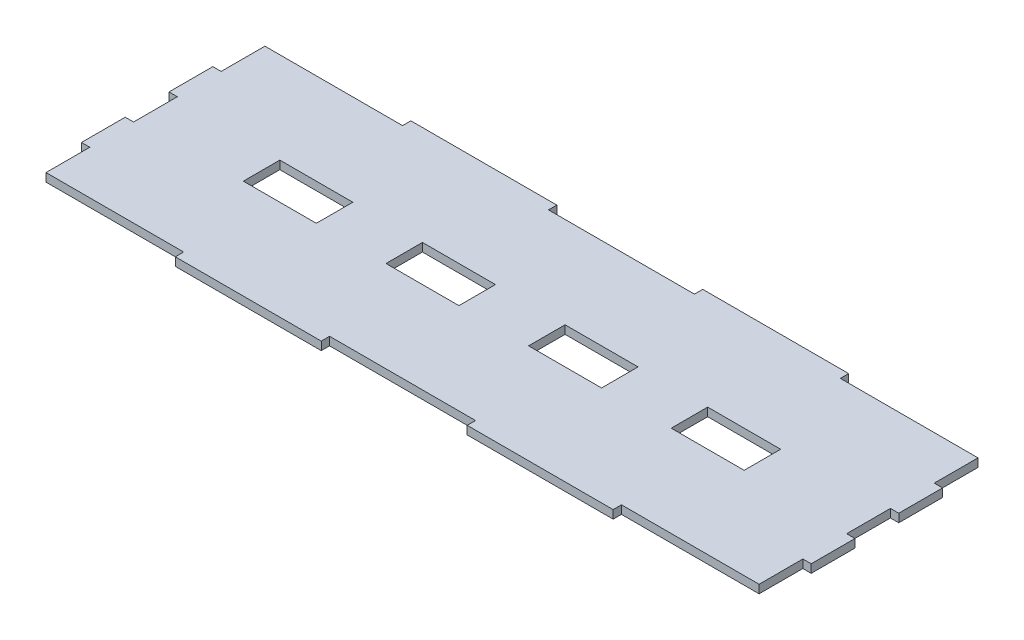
ISO-10303-21;
HEADER;
FILE_DESCRIPTION(('STEP AP214'),'2;1');
FILE_NAME('part.step','',(''),(''),'','','');
FILE_SCHEMA(('AUTOMOTIVE_DESIGN { 1 0 10303 214 1 1 1 1 }'));
ENDSEC;
DATA;
#1=APPLICATION_CONTEXT('core data for automotive mechanical design processes');
#2=APPLICATION_PROTOCOL_DEFINITION('international standard','automotive_design',2000,#1);
#3=PRODUCT_CONTEXT('',#1,'mechanical');
#4=PRODUCT('Part','Part','',(#3));
#5=PRODUCT_RELATED_PRODUCT_CATEGORY('part','',(#4));
#6=PRODUCT_DEFINITION_FORMATION('','',#4);
#7=PRODUCT_DEFINITION_CONTEXT('part definition',#1,'design');
#8=PRODUCT_DEFINITION('design','',#6,#7);
#9=PRODUCT_DEFINITION_SHAPE('','',#8);
#10=(LENGTH_UNIT() NAMED_UNIT(*) SI_UNIT(.MILLI.,.METRE.));
#11=(NAMED_UNIT(*) PLANE_ANGLE_UNIT() SI_UNIT($,.RADIAN.));
#12=(NAMED_UNIT(*) SI_UNIT($,.STERADIAN.) SOLID_ANGLE_UNIT());
#13=UNCERTAINTY_MEASURE_WITH_UNIT(LENGTH_MEASURE(1.E-05),#10,'distance_accuracy_value','');
#14=(GEOMETRIC_REPRESENTATION_CONTEXT(3) GLOBAL_UNCERTAINTY_ASSIGNED_CONTEXT((#13)) GLOBAL_UNIT_ASSIGNED_CONTEXT((#10,
#11,#12)) REPRESENTATION_CONTEXT('',''));
#15=CARTESIAN_POINT('',(0.,0.,0.));
#16=DIRECTION('',(0.,0.,1.));
#17=DIRECTION('',(1.,0.,0.));
#18=AXIS2_PLACEMENT_3D('',#15,#16,#17);
#19=CARTESIAN_POINT('',(0.,2.28,0.));
#20=DIRECTION('',(0.,1.,0.));
#21=DIRECTION('',(0.,0.,1.));
#22=AXIS2_PLACEMENT_3D('',#19,#20,#21);
#23=PLANE('',#22);
#24=DIRECTION('',(-1.,0.,0.));
#25=VECTOR('',#24,1.);
#26=CARTESIAN_POINT('',(0.,2.28,-18.));
#27=LINE('',#26,#25);
#28=CARTESIAN_POINT('',(-97.72,2.28,-18.));
#29=VERTEX_POINT('',#28);
#30=CARTESIAN_POINT('',(-100.,2.28,-18.));
#31=VERTEX_POINT('',#30);
#32=EDGE_CURVE('E459',#29,#31,#27,.T.);
#33=ORIENTED_EDGE('',*,*,#32,.T.);
#34=DIRECTION('',(0.,0.,1.));
#35=VECTOR('',#34,1.);
#36=CARTESIAN_POINT('',(-100.,2.28,0.));
#37=LINE('',#36,#35);
#38=CARTESIAN_POINT('',(-100.,2.28,-5.99999999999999));
#39=VERTEX_POINT('',#38);
#40=EDGE_CURVE('E462',#31,#39,#37,.T.);
#41=ORIENTED_EDGE('',*,*,#40,.T.);
#42=DIRECTION('',(1.,0.,0.));
#43=VECTOR('',#42,1.);
#44=CARTESIAN_POINT('',(0.,2.28,-5.99999999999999));
#45=LINE('',#44,#43);
#46=CARTESIAN_POINT('',(-97.72,2.28,-5.99999999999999));
#47=VERTEX_POINT('',#46);
#48=EDGE_CURVE('E465',#39,#47,#45,.T.);
#49=ORIENTED_EDGE('',*,*,#48,.T.);
#50=DIRECTION('',(0.,0.,1.));
#51=VECTOR('',#50,1.);
#52=CARTESIAN_POINT('',(-97.72,2.28,0.));
#53=LINE('',#52,#51);
#54=CARTESIAN_POINT('',(-97.72,2.28,6.00000000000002));
#55=VERTEX_POINT('',#54);
#56=EDGE_CURVE('E467',#47,#55,#53,.T.);
#57=ORIENTED_EDGE('',*,*,#56,.T.);
#58=DIRECTION('',(-1.,0.,0.));
#59=VECTOR('',#58,1.);
#60=CARTESIAN_POINT('',(0.,2.28,6.00000000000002));
#61=LINE('',#60,#59);
#62=CARTESIAN_POINT('',(-100.,2.28,6.00000000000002));
#63=VERTEX_POINT('',#62);
#64=EDGE_CURVE('E469',#55,#63,#61,.T.);
#65=ORIENTED_EDGE('',*,*,#64,.T.);
#66=DIRECTION('',(0.,0.,1.));
#67=VECTOR('',#66,1.);
#68=CARTESIAN_POINT('',(-100.,2.28,0.));
#69=LINE('',#68,#67);
#70=CARTESIAN_POINT('',(-100.,2.28,18.));
#71=VERTEX_POINT('',#70);
#72=EDGE_CURVE('E471',#63,#71,#69,.T.);
#73=ORIENTED_EDGE('',*,*,#72,.T.);
#74=DIRECTION('',(1.,0.,0.));
#75=VECTOR('',#74,1.);
#76=CARTESIAN_POINT('',(0.,2.28,18.));
#77=LINE('',#76,#75);
#78=CARTESIAN_POINT('',(-97.72,2.28,18.));
#79=VERTEX_POINT('',#78);
#80=EDGE_CURVE('E473',#71,#79,#77,.T.);
#81=ORIENTED_EDGE('',*,*,#80,.T.);
#82=DIRECTION('',(0.,0.,1.));
#83=VECTOR('',#82,1.);
#84=CARTESIAN_POINT('',(-97.72,2.28,0.));
#85=LINE('',#84,#83);
#86=CARTESIAN_POINT('',(-97.72,2.28,30.));
#87=VERTEX_POINT('',#86);
#88=EDGE_CURVE('E475',#79,#87,#85,.T.);
#89=ORIENTED_EDGE('',*,*,#88,.T.);
#90=DIRECTION('',(1.,0.,0.));
#91=VECTOR('',#90,1.);
#92=CARTESIAN_POINT('',(0.,2.28,30.));
#93=LINE('',#92,#91);
#94=CARTESIAN_POINT('',(-60.,2.28,30.));
#95=VERTEX_POINT('',#94);
#96=EDGE_CURVE('E477',#87,#95,#93,.T.);
#97=ORIENTED_EDGE('',*,*,#96,.T.);
#98=DIRECTION('',(0.,0.,1.));
#99=VECTOR('',#98,1.);
#100=CARTESIAN_POINT('',(-60.,2.28,0.));
#101=LINE('',#100,#99);
#102=CARTESIAN_POINT('',(-60.,2.28,32.28));
#103=VERTEX_POINT('',#102);
#104=EDGE_CURVE('E479',#95,#103,#101,.T.);
#105=ORIENTED_EDGE('',*,*,#104,.T.);
#106=DIRECTION('',(1.,0.,0.));
#107=VECTOR('',#106,1.);
#108=CARTESIAN_POINT('',(0.,2.28,32.28));
#109=LINE('',#108,#107);
#110=CARTESIAN_POINT('',(-20.,2.28,32.28));
#111=VERTEX_POINT('',#110);
#112=EDGE_CURVE('E481',#103,#111,#109,.T.);
#113=ORIENTED_EDGE('',*,*,#112,.T.);
#114=DIRECTION('',(0.,0.,-1.));
#115=VECTOR('',#114,1.);
#116=CARTESIAN_POINT('',(-20.,2.28,0.));
#117=LINE('',#116,#115);
#118=CARTESIAN_POINT('',(-20.,2.28,30.));
#119=VERTEX_POINT('',#118);
#120=EDGE_CURVE('E483',#111,#119,#117,.T.);
#121=ORIENTED_EDGE('',*,*,#120,.T.);
#122=DIRECTION('',(-1.,0.,0.));
#123=VECTOR('',#122,1.);
#124=CARTESIAN_POINT('',(0.,2.28,30.));
#125=LINE('',#124,#123);
#126=CARTESIAN_POINT('',(20.,2.28,30.));
#127=VERTEX_POINT('',#126);
#128=EDGE_CURVE('E485',#127,#119,#125,.T.);
#129=ORIENTED_EDGE('',*,*,#128,.F.);
#130=DIRECTION('',(0.,0.,1.));
#131=VECTOR('',#130,1.);
#132=CARTESIAN_POINT('',(20.,2.28,0.));
#133=LINE('',#132,#131);
#134=CARTESIAN_POINT('',(20.,2.28,32.28));
#135=VERTEX_POINT('',#134);
#136=EDGE_CURVE('E488',#127,#135,#133,.T.);
#137=ORIENTED_EDGE('',*,*,#136,.T.);
#138=DIRECTION('',(1.,0.,0.));
#139=VECTOR('',#138,1.);
#140=CARTESIAN_POINT('',(0.,2.28,32.28));
#141=LINE('',#140,#139);
#142=CARTESIAN_POINT('',(60.,2.28,32.28));
#143=VERTEX_POINT('',#142);
#144=EDGE_CURVE('E490',#135,#143,#141,.T.);
#145=ORIENTED_EDGE('',*,*,#144,.T.);
#146=DIRECTION('',(0.,0.,-1.));
#147=VECTOR('',#146,1.);
#148=CARTESIAN_POINT('',(60.,2.28,0.));
#149=LINE('',#148,#147);
#150=CARTESIAN_POINT('',(60.,2.28,30.));
#151=VERTEX_POINT('',#150);
#152=EDGE_CURVE('E492',#143,#151,#149,.T.);
#153=ORIENTED_EDGE('',*,*,#152,.T.);
#154=DIRECTION('',(1.,0.,0.));
#155=VECTOR('',#154,1.);
#156=CARTESIAN_POINT('',(0.,2.28,30.));
#157=LINE('',#156,#155);
#158=CARTESIAN_POINT('',(97.72,2.28,30.));
#159=VERTEX_POINT('',#158);
#160=EDGE_CURVE('E494',#151,#159,#157,.T.);
#161=ORIENTED_EDGE('',*,*,#160,.T.);
#162=DIRECTION('',(0.,0.,1.));
#163=VECTOR('',#162,1.);
#164=CARTESIAN_POINT('',(97.72,2.28,0.));
#165=LINE('',#164,#163);
#166=CARTESIAN_POINT('',(97.72,2.28,18.));
#167=VERTEX_POINT('',#166);
#168=EDGE_CURVE('E496',#167,#159,#165,.T.);
#169=ORIENTED_EDGE('',*,*,#168,.F.);
#170=DIRECTION('',(-1.,0.,0.));
#171=VECTOR('',#170,1.);
#172=CARTESIAN_POINT('',(0.,2.28,18.));
#173=LINE('',#172,#171);
#174=CARTESIAN_POINT('',(100.,2.28,18.));
#175=VERTEX_POINT('',#174);
#176=EDGE_CURVE('E499',#175,#167,#173,.T.);
#177=ORIENTED_EDGE('',*,*,#176,.F.);
#178=DIRECTION('',(0.,0.,1.));
#179=VECTOR('',#178,1.);
#180=CARTESIAN_POINT('',(100.,2.28,0.));
#181=LINE('',#180,#179);
#182=CARTESIAN_POINT('',(100.,2.28,6.00000000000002));
#183=VERTEX_POINT('',#182);
#184=EDGE_CURVE('E502',#183,#175,#181,.T.);
#185=ORIENTED_EDGE('',*,*,#184,.F.);
#186=DIRECTION('',(1.,0.,0.));
#187=VECTOR('',#186,1.);
#188=CARTESIAN_POINT('',(0.,2.28,6.00000000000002));
#189=LINE('',#188,#187);
#190=CARTESIAN_POINT('',(97.72,2.28,6.00000000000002));
#191=VERTEX_POINT('',#190);
#192=EDGE_CURVE('E505',#191,#183,#189,.T.);
#193=ORIENTED_EDGE('',*,*,#192,.F.);
#194=DIRECTION('',(0.,0.,1.));
#195=VECTOR('',#194,1.);
#196=CARTESIAN_POINT('',(97.72,2.28,0.));
#197=LINE('',#196,#195);
#198=CARTESIAN_POINT('',(97.72,2.28,-5.99999999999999));
#199=VERTEX_POINT('',#198);
#200=EDGE_CURVE('E508',#199,#191,#197,.T.);
#201=ORIENTED_EDGE('',*,*,#200,.F.);
#202=DIRECTION('',(-1.,0.,0.));
#203=VECTOR('',#202,1.);
#204=CARTESIAN_POINT('',(0.,2.28,-5.99999999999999));
#205=LINE('',#204,#203);
#206=CARTESIAN_POINT('',(100.,2.28,-5.99999999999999));
#207=VERTEX_POINT('',#206);
#208=EDGE_CURVE('E511',#207,#199,#205,.T.);
#209=ORIENTED_EDGE('',*,*,#208,.F.);
#210=DIRECTION('',(0.,0.,1.));
#211=VECTOR('',#210,1.);
#212=CARTESIAN_POINT('',(100.,2.28,0.));
#213=LINE('',#212,#211);
#214=CARTESIAN_POINT('',(100.,2.28,-18.));
#215=VERTEX_POINT('',#214);
#216=EDGE_CURVE('E514',#215,#207,#213,.T.);
#217=ORIENTED_EDGE('',*,*,#216,.F.);
#218=DIRECTION('',(1.,0.,0.));
#219=VECTOR('',#218,1.);
#220=CARTESIAN_POINT('',(0.,2.28,-18.));
#221=LINE('',#220,#219);
#222=CARTESIAN_POINT('',(97.72,2.28,-18.));
#223=VERTEX_POINT('',#222);
#224=EDGE_CURVE('E517',#223,#215,#221,.T.);
#225=ORIENTED_EDGE('',*,*,#224,.F.);
#226=DIRECTION('',(0.,0.,1.));
#227=VECTOR('',#226,1.);
#228=CARTESIAN_POINT('',(97.72,2.28,0.));
#229=LINE('',#228,#227);
#230=CARTESIAN_POINT('',(97.72,2.28,-30.));
#231=VERTEX_POINT('',#230);
#232=EDGE_CURVE('E520',#231,#223,#229,.T.);
#233=ORIENTED_EDGE('',*,*,#232,.F.);
#234=DIRECTION('',(1.,0.,0.));
#235=VECTOR('',#234,1.);
#236=CARTESIAN_POINT('',(0.,2.28,-30.));
#237=LINE('',#236,#235);
#238=CARTESIAN_POINT('',(60.,2.28,-30.));
#239=VERTEX_POINT('',#238);
#240=EDGE_CURVE('E523',#239,#231,#237,.T.);
#241=ORIENTED_EDGE('',*,*,#240,.F.);
#242=DIRECTION('',(0.,0.,1.));
#243=VECTOR('',#242,1.);
#244=CARTESIAN_POINT('',(60.,2.28,0.));
#245=LINE('',#244,#243);
#246=CARTESIAN_POINT('',(60.,2.28,-32.28));
#247=VERTEX_POINT('',#246);
#248=EDGE_CURVE('E526',#247,#239,#245,.T.);
#249=ORIENTED_EDGE('',*,*,#248,.F.);
#250=DIRECTION('',(1.,0.,0.));
#251=VECTOR('',#250,1.);
#252=CARTESIAN_POINT('',(0.,2.28,-32.28));
#253=LINE('',#252,#251);
#254=CARTESIAN_POINT('',(20.,2.28,-32.28));
#255=VERTEX_POINT('',#254);
#256=EDGE_CURVE('E529',#255,#247,#253,.T.);
#257=ORIENTED_EDGE('',*,*,#256,.F.);
#258=DIRECTION('',(0.,0.,-1.));
#259=VECTOR('',#258,1.);
#260=CARTESIAN_POINT('',(20.,2.28,0.));
#261=LINE('',#260,#259);
#262=CARTESIAN_POINT('',(20.,2.28,-30.));
#263=VERTEX_POINT('',#262);
#264=EDGE_CURVE('E532',#263,#255,#261,.T.);
#265=ORIENTED_EDGE('',*,*,#264,.F.);
#266=DIRECTION('',(1.,0.,0.));
#267=VECTOR('',#266,1.);
#268=CARTESIAN_POINT('',(0.,2.28,-30.));
#269=LINE('',#268,#267);
#270=CARTESIAN_POINT('',(-20.,2.28,-30.));
#271=VERTEX_POINT('',#270);
#272=EDGE_CURVE('E535',#271,#263,#269,.T.);
#273=ORIENTED_EDGE('',*,*,#272,.F.);
#274=DIRECTION('',(0.,0.,1.));
#275=VECTOR('',#274,1.);
#276=CARTESIAN_POINT('',(-20.,2.28,0.));
#277=LINE('',#276,#275);
#278=CARTESIAN_POINT('',(-20.,2.28,-32.28));
#279=VERTEX_POINT('',#278);
#280=EDGE_CURVE('E538',#279,#271,#277,.T.);
#281=ORIENTED_EDGE('',*,*,#280,.F.);
#282=DIRECTION('',(1.,0.,0.));
#283=VECTOR('',#282,1.);
#284=CARTESIAN_POINT('',(0.,2.28,-32.28));
#285=LINE('',#284,#283);
#286=CARTESIAN_POINT('',(-60.,2.28,-32.28));
#287=VERTEX_POINT('',#286);
#288=EDGE_CURVE('E541',#287,#279,#285,.T.);
#289=ORIENTED_EDGE('',*,*,#288,.F.);
#290=DIRECTION('',(0.,0.,-1.));
#291=VECTOR('',#290,1.);
#292=CARTESIAN_POINT('',(-60.,2.28,0.));
#293=LINE('',#292,#291);
#294=CARTESIAN_POINT('',(-60.,2.28,-30.));
#295=VERTEX_POINT('',#294);
#296=EDGE_CURVE('E544',#295,#287,#293,.T.);
#297=ORIENTED_EDGE('',*,*,#296,.F.);
#298=DIRECTION('',(1.,0.,0.));
#299=VECTOR('',#298,1.);
#300=CARTESIAN_POINT('',(0.,2.28,-30.));
#301=LINE('',#300,#299);
#302=CARTESIAN_POINT('',(-97.72,2.28,-30.));
#303=VERTEX_POINT('',#302);
#304=EDGE_CURVE('E547',#303,#295,#301,.T.);
#305=ORIENTED_EDGE('',*,*,#304,.F.);
#306=DIRECTION('',(0.,0.,1.));
#307=VECTOR('',#306,1.);
#308=CARTESIAN_POINT('',(-97.72,2.28,0.));
#309=LINE('',#308,#307);
#310=EDGE_CURVE('E550',#303,#29,#309,.T.);
#311=ORIENTED_EDGE('',*,*,#310,.T.);
#312=EDGE_LOOP('',(#33,#41,#49,#57,#65,#73,#81,#89,#97,#105,#113,#121,#129,#137,#145,#153,#161,
#169,#177,#185,#193,#201,#209,#217,#225,#233,#241,#249,#257,#265,#273,#281,#289,#297,#305,#311));
#313=FACE_BOUND('',#312,.T.);
#314=DIRECTION('',(1.,0.,0.));
#315=VECTOR('',#314,1.);
#316=CARTESIAN_POINT('',(0.,2.28,-5.));
#317=LINE('',#316,#315);
#318=CARTESIAN_POINT('',(-68.632,2.28,-5.));
#319=VERTEX_POINT('',#318);
#320=CARTESIAN_POINT('',(-48.632,2.28,-5.));
#321=VERTEX_POINT('',#320);
#322=EDGE_CURVE('E442',#319,#321,#317,.T.);
#323=ORIENTED_EDGE('',*,*,#322,.T.);
#324=DIRECTION('',(0.,0.,1.));
#325=VECTOR('',#324,1.);
#326=CARTESIAN_POINT('',(-48.632,2.28,0.));
#327=LINE('',#326,#325);
#328=CARTESIAN_POINT('',(-48.632,2.28,5.));
#329=VERTEX_POINT('',#328);
#330=EDGE_CURVE('E439',#321,#329,#327,.T.);
#331=ORIENTED_EDGE('',*,*,#330,.T.);
#332=DIRECTION('',(1.,0.,0.));
#333=VECTOR('',#332,1.);
#334=CARTESIAN_POINT('',(0.,2.28,5.));
#335=LINE('',#334,#333);
#336=CARTESIAN_POINT('',(-68.632,2.28,5.));
#337=VERTEX_POINT('',#336);
#338=EDGE_CURVE('E448',#337,#329,#335,.T.);
#339=ORIENTED_EDGE('',*,*,#338,.F.);
#340=DIRECTION('',(0.,0.,1.));
#341=VECTOR('',#340,1.);
#342=CARTESIAN_POINT('',(-68.632,2.28,0.));
#343=LINE('',#342,#341);
#344=EDGE_CURVE('E445',#319,#337,#343,.T.);
#345=ORIENTED_EDGE('',*,*,#344,.F.);
#346=EDGE_LOOP('',(#323,#331,#339,#345));
#347=FACE_BOUND('',#346,.T.);
#348=DIRECTION('',(1.,0.,0.));
#349=VECTOR('',#348,1.);
#350=CARTESIAN_POINT('',(0.,2.28,-4.99999999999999));
#351=LINE('',#350,#349);
#352=CARTESIAN_POINT('',(-29.544,2.28,-4.99999999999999));
#353=VERTEX_POINT('',#352);
#354=CARTESIAN_POINT('',(-9.54400000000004,2.28,-4.99999999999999));
#355=VERTEX_POINT('',#354);
#356=EDGE_CURVE('E421',#353,#355,#351,.T.);
#357=ORIENTED_EDGE('',*,*,#356,.T.);
#358=DIRECTION('',(0.,0.,1.));
#359=VECTOR('',#358,1.);
#360=CARTESIAN_POINT('',(-9.54400000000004,2.28,0.));
#361=LINE('',#360,#359);
#362=CARTESIAN_POINT('',(-9.54400000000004,2.28,5.00000000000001));
#363=VERTEX_POINT('',#362);
#364=EDGE_CURVE('E418',#355,#363,#361,.T.);
#365=ORIENTED_EDGE('',*,*,#364,.T.);
#366=DIRECTION('',(1.,0.,0.));
#367=VECTOR('',#366,1.);
#368=CARTESIAN_POINT('',(0.,2.28,5.00000000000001));
#369=LINE('',#368,#367);
#370=CARTESIAN_POINT('',(-29.544,2.28,5.00000000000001));
#371=VERTEX_POINT('',#370);
#372=EDGE_CURVE('E428',#371,#363,#369,.T.);
#373=ORIENTED_EDGE('',*,*,#372,.F.);
#374=DIRECTION('',(0.,0.,1.));
#375=VECTOR('',#374,1.);
#376=CARTESIAN_POINT('',(-29.544,2.28,0.));
#377=LINE('',#376,#375);
#378=EDGE_CURVE('E425',#353,#371,#377,.T.);
#379=ORIENTED_EDGE('',*,*,#378,.F.);
#380=EDGE_LOOP('',(#357,#365,#373,#379));
#381=FACE_BOUND('',#380,.T.);
#382=DIRECTION('',(1.,0.,0.));
#383=VECTOR('',#382,1.);
#384=CARTESIAN_POINT('',(0.,2.28,-5.));
#385=LINE('',#384,#383);
#386=CARTESIAN_POINT('',(9.54399999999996,2.28,-5.));
#387=VERTEX_POINT('',#386);
#388=CARTESIAN_POINT('',(29.544,2.28,-5.));
#389=VERTEX_POINT('',#388);
#390=EDGE_CURVE('E400',#387,#389,#385,.T.);
#391=ORIENTED_EDGE('',*,*,#390,.T.);
#392=DIRECTION('',(0.,0.,1.));
#393=VECTOR('',#392,1.);
#394=CARTESIAN_POINT('',(29.544,2.28,0.));
#395=LINE('',#394,#393);
#396=CARTESIAN_POINT('',(29.544,2.28,5.));
#397=VERTEX_POINT('',#396);
#398=EDGE_CURVE('E62',#389,#397,#395,.T.);
#399=ORIENTED_EDGE('',*,*,#398,.T.);
#400=DIRECTION('',(1.,0.,0.));
#401=VECTOR('',#400,1.);
#402=CARTESIAN_POINT('',(0.,2.28,5.));
#403=LINE('',#402,#401);
#404=CARTESIAN_POINT('',(9.54399999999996,2.28,5.));
#405=VERTEX_POINT('',#404);
#406=EDGE_CURVE('E407',#405,#397,#403,.T.);
#407=ORIENTED_EDGE('',*,*,#406,.F.);
#408=DIRECTION('',(0.,0.,1.));
#409=VECTOR('',#408,1.);
#410=CARTESIAN_POINT('',(9.54399999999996,2.28,0.));
#411=LINE('',#410,#409);
#412=EDGE_CURVE('E404',#387,#405,#411,.T.);
#413=ORIENTED_EDGE('',*,*,#412,.F.);
#414=EDGE_LOOP('',(#391,#399,#407,#413));
#415=FACE_BOUND('',#414,.T.);
#416=DIRECTION('',(1.,0.,0.));
#417=VECTOR('',#416,1.);
#418=CARTESIAN_POINT('',(0.,2.28,-5.));
#419=LINE('',#418,#417);
#420=CARTESIAN_POINT('',(48.632,2.28,-5.));
#421=VERTEX_POINT('',#420);
#422=CARTESIAN_POINT('',(68.6319999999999,2.28,-5.));
#423=VERTEX_POINT('',#422);
#424=EDGE_CURVE('E384',#421,#423,#419,.T.);
#425=ORIENTED_EDGE('',*,*,#424,.T.);
#426=DIRECTION('',(0.,0.,1.));
#427=VECTOR('',#426,1.);
#428=CARTESIAN_POINT('',(68.6319999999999,2.28,0.));
#429=LINE('',#428,#427);
#430=CARTESIAN_POINT('',(68.6319999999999,2.28,5.));
#431=VERTEX_POINT('',#430);
#432=EDGE_CURVE('E54',#423,#431,#429,.T.);
#433=ORIENTED_EDGE('',*,*,#432,.T.);
#434=DIRECTION('',(1.,0.,0.));
#435=VECTOR('',#434,1.);
#436=CARTESIAN_POINT('',(0.,2.28,5.));
#437=LINE('',#436,#435);
#438=CARTESIAN_POINT('',(48.632,2.28,5.));
#439=VERTEX_POINT('',#438);
#440=EDGE_CURVE('E389',#439,#431,#437,.T.);
#441=ORIENTED_EDGE('',*,*,#440,.F.);
#442=DIRECTION('',(0.,0.,1.));
#443=VECTOR('',#442,1.);
#444=CARTESIAN_POINT('',(48.632,2.28,0.));
#445=LINE('',#444,#443);
#446=EDGE_CURVE('E374',#421,#439,#445,.T.);
#447=ORIENTED_EDGE('',*,*,#446,.F.);
#448=EDGE_LOOP('',(#425,#433,#441,#447));
#449=FACE_BOUND('',#448,.T.);
#450=ADVANCED_FACE('F39',(#313,#347,#381,#415,#449),#23,.T.);
#451=CARTESIAN_POINT('',(0.,0.,0.));
#452=DIRECTION('',(0.,1.,0.));
#453=DIRECTION('',(0.,0.,1.));
#454=AXIS2_PLACEMENT_3D('',#451,#452,#453);
#455=PLANE('',#454);
#456=DIRECTION('',(0.,0.,1.));
#457=VECTOR('',#456,1.);
#458=CARTESIAN_POINT('',(29.544,0.,0.));
#459=LINE('',#458,#457);
#460=CARTESIAN_POINT('',(29.544,0.,-5.));
#461=VERTEX_POINT('',#460);
#462=CARTESIAN_POINT('',(29.544,0.,5.));
#463=VERTEX_POINT('',#462);
#464=EDGE_CURVE('E759',#461,#463,#459,.T.);
#465=ORIENTED_EDGE('',*,*,#464,.F.);
#466=DIRECTION('',(1.,0.,0.));
#467=VECTOR('',#466,1.);
#468=CARTESIAN_POINT('',(0.,0.,-5.));
#469=LINE('',#468,#467);
#470=CARTESIAN_POINT('',(9.54399999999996,0.,-5.));
#471=VERTEX_POINT('',#470);
#472=EDGE_CURVE('E751',#471,#461,#469,.T.);
#473=ORIENTED_EDGE('',*,*,#472,.F.);
#474=DIRECTION('',(0.,0.,1.));
#475=VECTOR('',#474,1.);
#476=CARTESIAN_POINT('',(9.54399999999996,0.,0.));
#477=LINE('',#476,#475);
#478=CARTESIAN_POINT('',(9.54399999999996,0.,5.));
#479=VERTEX_POINT('',#478);
#480=EDGE_CURVE('E753',#471,#479,#477,.T.);
#481=ORIENTED_EDGE('',*,*,#480,.T.);
#482=DIRECTION('',(1.,0.,0.));
#483=VECTOR('',#482,1.);
#484=CARTESIAN_POINT('',(0.,0.,5.));
#485=LINE('',#484,#483);
#486=EDGE_CURVE('E756',#479,#463,#485,.T.);
#487=ORIENTED_EDGE('',*,*,#486,.T.);
#488=EDGE_LOOP('',(#465,#473,#481,#487));
#489=FACE_BOUND('',#488,.T.);
#490=DIRECTION('',(0.,0.,1.));
#491=VECTOR('',#490,1.);
#492=CARTESIAN_POINT('',(-48.632,0.,0.));
#493=LINE('',#492,#491);
#494=CARTESIAN_POINT('',(-48.632,0.,-5.));
#495=VERTEX_POINT('',#494);
#496=CARTESIAN_POINT('',(-48.632,0.,5.));
#497=VERTEX_POINT('',#496);
#498=EDGE_CURVE('E739',#495,#497,#493,.T.);
#499=ORIENTED_EDGE('',*,*,#498,.F.);
#500=DIRECTION('',(1.,0.,0.));
#501=VECTOR('',#500,1.);
#502=CARTESIAN_POINT('',(0.,0.,-5.));
#503=LINE('',#502,#501);
#504=CARTESIAN_POINT('',(-68.632,0.,-5.));
#505=VERTEX_POINT('',#504);
#506=EDGE_CURVE('E731',#505,#495,#503,.T.);
#507=ORIENTED_EDGE('',*,*,#506,.F.);
#508=DIRECTION('',(0.,0.,1.));
#509=VECTOR('',#508,1.);
#510=CARTESIAN_POINT('',(-68.632,0.,0.));
#511=LINE('',#510,#509);
#512=CARTESIAN_POINT('',(-68.632,0.,5.));
#513=VERTEX_POINT('',#512);
#514=EDGE_CURVE('E733',#505,#513,#511,.T.);
#515=ORIENTED_EDGE('',*,*,#514,.T.);
#516=DIRECTION('',(1.,0.,0.));
#517=VECTOR('',#516,1.);
#518=CARTESIAN_POINT('',(0.,0.,5.));
#519=LINE('',#518,#517);
#520=EDGE_CURVE('E736',#513,#497,#519,.T.);
#521=ORIENTED_EDGE('',*,*,#520,.T.);
#522=EDGE_LOOP('',(#499,#507,#515,#521));
#523=FACE_BOUND('',#522,.T.);
#524=DIRECTION('',(-1.,0.,0.));
#525=VECTOR('',#524,1.);
#526=CARTESIAN_POINT('',(0.,0.,-18.));
#527=LINE('',#526,#525);
#528=CARTESIAN_POINT('',(-97.72,0.,-18.));
#529=VERTEX_POINT('',#528);
#530=CARTESIAN_POINT('',(-100.,0.,-18.));
#531=VERTEX_POINT('',#530);
#532=EDGE_CURVE('E396',#529,#531,#527,.T.);
#533=ORIENTED_EDGE('',*,*,#532,.F.);
#534=DIRECTION('',(0.,0.,1.));
#535=VECTOR('',#534,1.);
#536=CARTESIAN_POINT('',(-97.72,0.,0.));
#537=LINE('',#536,#535);
#538=CARTESIAN_POINT('',(-97.72,0.,-30.));
#539=VERTEX_POINT('',#538);
#540=EDGE_CURVE('E463',#539,#529,#537,.T.);
#541=ORIENTED_EDGE('',*,*,#540,.F.);
#542=DIRECTION('',(1.,0.,0.));
#543=VECTOR('',#542,1.);
#544=CARTESIAN_POINT('',(0.,0.,-30.));
#545=LINE('',#544,#543);
#546=CARTESIAN_POINT('',(-60.,0.,-30.));
#547=VERTEX_POINT('',#546);
#548=EDGE_CURVE('E641',#539,#547,#545,.T.);
#549=ORIENTED_EDGE('',*,*,#548,.T.);
#550=DIRECTION('',(0.,0.,-1.));
#551=VECTOR('',#550,1.);
#552=CARTESIAN_POINT('',(-60.,0.,0.));
#553=LINE('',#552,#551);
#554=CARTESIAN_POINT('',(-60.,0.,-32.28));
#555=VERTEX_POINT('',#554);
#556=EDGE_CURVE('E638',#547,#555,#553,.T.);
#557=ORIENTED_EDGE('',*,*,#556,.T.);
#558=DIRECTION('',(1.,0.,0.));
#559=VECTOR('',#558,1.);
#560=CARTESIAN_POINT('',(0.,0.,-32.28));
#561=LINE('',#560,#559);
#562=CARTESIAN_POINT('',(-20.,0.,-32.28));
#563=VERTEX_POINT('',#562);
#564=EDGE_CURVE('E635',#555,#563,#561,.T.);
#565=ORIENTED_EDGE('',*,*,#564,.T.);
#566=DIRECTION('',(0.,0.,1.));
#567=VECTOR('',#566,1.);
#568=CARTESIAN_POINT('',(-20.,0.,0.));
#569=LINE('',#568,#567);
#570=CARTESIAN_POINT('',(-20.,0.,-30.));
#571=VERTEX_POINT('',#570);
#572=EDGE_CURVE('E632',#563,#571,#569,.T.);
#573=ORIENTED_EDGE('',*,*,#572,.T.);
#574=DIRECTION('',(1.,0.,0.));
#575=VECTOR('',#574,1.);
#576=CARTESIAN_POINT('',(0.,0.,-30.));
#577=LINE('',#576,#575);
#578=CARTESIAN_POINT('',(20.,0.,-30.));
#579=VERTEX_POINT('',#578);
#580=EDGE_CURVE('E629',#571,#579,#577,.T.);
#581=ORIENTED_EDGE('',*,*,#580,.T.);
#582=DIRECTION('',(0.,0.,-1.));
#583=VECTOR('',#582,1.);
#584=CARTESIAN_POINT('',(20.,0.,0.));
#585=LINE('',#584,#583);
#586=CARTESIAN_POINT('',(20.,0.,-32.28));
#587=VERTEX_POINT('',#586);
#588=EDGE_CURVE('E626',#579,#587,#585,.T.);
#589=ORIENTED_EDGE('',*,*,#588,.T.);
#590=DIRECTION('',(1.,0.,0.));
#591=VECTOR('',#590,1.);
#592=CARTESIAN_POINT('',(0.,0.,-32.28));
#593=LINE('',#592,#591);
#594=CARTESIAN_POINT('',(60.,0.,-32.28));
#595=VERTEX_POINT('',#594);
#596=EDGE_CURVE('E623',#587,#595,#593,.T.);
#597=ORIENTED_EDGE('',*,*,#596,.T.);
#598=DIRECTION('',(0.,0.,1.));
#599=VECTOR('',#598,1.);
#600=CARTESIAN_POINT('',(60.,0.,0.));
#601=LINE('',#600,#599);
#602=CARTESIAN_POINT('',(60.,0.,-30.));
#603=VERTEX_POINT('',#602);
#604=EDGE_CURVE('E620',#595,#603,#601,.T.);
#605=ORIENTED_EDGE('',*,*,#604,.T.);
#606=DIRECTION('',(1.,0.,0.));
#607=VECTOR('',#606,1.);
#608=CARTESIAN_POINT('',(0.,0.,-30.));
#609=LINE('',#608,#607);
#610=CARTESIAN_POINT('',(97.72,0.,-30.));
#611=VERTEX_POINT('',#610);
#612=EDGE_CURVE('E617',#603,#611,#609,.T.);
#613=ORIENTED_EDGE('',*,*,#612,.T.);
#614=DIRECTION('',(0.,0.,1.));
#615=VECTOR('',#614,1.);
#616=CARTESIAN_POINT('',(97.72,0.,0.));
#617=LINE('',#616,#615);
#618=CARTESIAN_POINT('',(97.72,0.,-18.));
#619=VERTEX_POINT('',#618);
#620=EDGE_CURVE('E614',#611,#619,#617,.T.);
#621=ORIENTED_EDGE('',*,*,#620,.T.);
#622=DIRECTION('',(1.,0.,0.));
#623=VECTOR('',#622,1.);
#624=CARTESIAN_POINT('',(0.,0.,-18.));
#625=LINE('',#624,#623);
#626=CARTESIAN_POINT('',(100.,0.,-18.));
#627=VERTEX_POINT('',#626);
#628=EDGE_CURVE('E611',#619,#627,#625,.T.);
#629=ORIENTED_EDGE('',*,*,#628,.T.);
#630=DIRECTION('',(0.,0.,1.));
#631=VECTOR('',#630,1.);
#632=CARTESIAN_POINT('',(100.,0.,0.));
#633=LINE('',#632,#631);
#634=CARTESIAN_POINT('',(100.,0.,-5.99999999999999));
#635=VERTEX_POINT('',#634);
#636=EDGE_CURVE('E608',#627,#635,#633,.T.);
#637=ORIENTED_EDGE('',*,*,#636,.T.);
#638=DIRECTION('',(-1.,0.,0.));
#639=VECTOR('',#638,1.);
#640=CARTESIAN_POINT('',(0.,0.,-5.99999999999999));
#641=LINE('',#640,#639);
#642=CARTESIAN_POINT('',(97.72,0.,-5.99999999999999));
#643=VERTEX_POINT('',#642);
#644=EDGE_CURVE('E605',#635,#643,#641,.T.);
#645=ORIENTED_EDGE('',*,*,#644,.T.);
#646=DIRECTION('',(0.,0.,1.));
#647=VECTOR('',#646,1.);
#648=CARTESIAN_POINT('',(97.72,0.,0.));
#649=LINE('',#648,#647);
#650=CARTESIAN_POINT('',(97.72,0.,6.00000000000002));
#651=VERTEX_POINT('',#650);
#652=EDGE_CURVE('E602',#643,#651,#649,.T.);
#653=ORIENTED_EDGE('',*,*,#652,.T.);
#654=DIRECTION('',(1.,0.,0.));
#655=VECTOR('',#654,1.);
#656=CARTESIAN_POINT('',(0.,0.,6.00000000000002));
#657=LINE('',#656,#655);
#658=CARTESIAN_POINT('',(100.,0.,6.00000000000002));
#659=VERTEX_POINT('',#658);
#660=EDGE_CURVE('E599',#651,#659,#657,.T.);
#661=ORIENTED_EDGE('',*,*,#660,.T.);
#662=DIRECTION('',(0.,0.,1.));
#663=VECTOR('',#662,1.);
#664=CARTESIAN_POINT('',(100.,0.,0.));
#665=LINE('',#664,#663);
#666=CARTESIAN_POINT('',(100.,0.,18.));
#667=VERTEX_POINT('',#666);
#668=EDGE_CURVE('E596',#659,#667,#665,.T.);
#669=ORIENTED_EDGE('',*,*,#668,.T.);
#670=DIRECTION('',(-1.,0.,0.));
#671=VECTOR('',#670,1.);
#672=CARTESIAN_POINT('',(0.,0.,18.));
#673=LINE('',#672,#671);
#674=CARTESIAN_POINT('',(97.72,0.,18.));
#675=VERTEX_POINT('',#674);
#676=EDGE_CURVE('E593',#667,#675,#673,.T.);
#677=ORIENTED_EDGE('',*,*,#676,.T.);
#678=DIRECTION('',(0.,0.,1.));
#679=VECTOR('',#678,1.);
#680=CARTESIAN_POINT('',(97.72,0.,0.));
#681=LINE('',#680,#679);
#682=CARTESIAN_POINT('',(97.72,0.,30.));
#683=VERTEX_POINT('',#682);
#684=EDGE_CURVE('E590',#675,#683,#681,.T.);
#685=ORIENTED_EDGE('',*,*,#684,.T.);
#686=DIRECTION('',(1.,0.,0.));
#687=VECTOR('',#686,1.);
#688=CARTESIAN_POINT('',(0.,0.,30.));
#689=LINE('',#688,#687);
#690=CARTESIAN_POINT('',(60.,0.,30.));
#691=VERTEX_POINT('',#690);
#692=EDGE_CURVE('E587',#691,#683,#689,.T.);
#693=ORIENTED_EDGE('',*,*,#692,.F.);
#694=DIRECTION('',(0.,0.,-1.));
#695=VECTOR('',#694,1.);
#696=CARTESIAN_POINT('',(60.,0.,0.));
#697=LINE('',#696,#695);
#698=CARTESIAN_POINT('',(60.,0.,32.28));
#699=VERTEX_POINT('',#698);
#700=EDGE_CURVE('E585',#699,#691,#697,.T.);
#701=ORIENTED_EDGE('',*,*,#700,.F.);
#702=DIRECTION('',(1.,0.,0.));
#703=VECTOR('',#702,1.);
#704=CARTESIAN_POINT('',(0.,0.,32.28));
#705=LINE('',#704,#703);
#706=CARTESIAN_POINT('',(20.,0.,32.28));
#707=VERTEX_POINT('',#706);
#708=EDGE_CURVE('E583',#707,#699,#705,.T.);
#709=ORIENTED_EDGE('',*,*,#708,.F.);
#710=DIRECTION('',(0.,0.,1.));
#711=VECTOR('',#710,1.);
#712=CARTESIAN_POINT('',(20.,0.,0.));
#713=LINE('',#712,#711);
#714=CARTESIAN_POINT('',(20.,0.,30.));
#715=VERTEX_POINT('',#714);
#716=EDGE_CURVE('E581',#715,#707,#713,.T.);
#717=ORIENTED_EDGE('',*,*,#716,.F.);
#718=DIRECTION('',(-1.,0.,0.));
#719=VECTOR('',#718,1.);
#720=CARTESIAN_POINT('',(0.,0.,30.));
#721=LINE('',#720,#719);
#722=CARTESIAN_POINT('',(-20.,0.,30.));
#723=VERTEX_POINT('',#722);
#724=EDGE_CURVE('E578',#715,#723,#721,.T.);
#725=ORIENTED_EDGE('',*,*,#724,.T.);
#726=DIRECTION('',(0.,0.,-1.));
#727=VECTOR('',#726,1.);
#728=CARTESIAN_POINT('',(-20.,0.,0.));
#729=LINE('',#728,#727);
#730=CARTESIAN_POINT('',(-20.,0.,32.28));
#731=VERTEX_POINT('',#730);
#732=EDGE_CURVE('E575',#731,#723,#729,.T.);
#733=ORIENTED_EDGE('',*,*,#732,.F.);
#734=DIRECTION('',(1.,0.,0.));
#735=VECTOR('',#734,1.);
#736=CARTESIAN_POINT('',(0.,0.,32.28));
#737=LINE('',#736,#735);
#738=CARTESIAN_POINT('',(-60.,0.,32.28));
#739=VERTEX_POINT('',#738);
#740=EDGE_CURVE('E573',#739,#731,#737,.T.);
#741=ORIENTED_EDGE('',*,*,#740,.F.);
#742=DIRECTION('',(0.,0.,1.));
#743=VECTOR('',#742,1.);
#744=CARTESIAN_POINT('',(-60.,0.,0.));
#745=LINE('',#744,#743);
#746=CARTESIAN_POINT('',(-60.,0.,30.));
#747=VERTEX_POINT('',#746);
#748=EDGE_CURVE('E571',#747,#739,#745,.T.);
#749=ORIENTED_EDGE('',*,*,#748,.F.);
#750=DIRECTION('',(1.,0.,0.));
#751=VECTOR('',#750,1.);
#752=CARTESIAN_POINT('',(0.,0.,30.));
#753=LINE('',#752,#751);
#754=CARTESIAN_POINT('',(-97.72,0.,30.));
#755=VERTEX_POINT('',#754);
#756=EDGE_CURVE('E569',#755,#747,#753,.T.);
#757=ORIENTED_EDGE('',*,*,#756,.F.);
#758=DIRECTION('',(0.,0.,1.));
#759=VECTOR('',#758,1.);
#760=CARTESIAN_POINT('',(-97.72,0.,0.));
#761=LINE('',#760,#759);
#762=CARTESIAN_POINT('',(-97.72,0.,18.));
#763=VERTEX_POINT('',#762);
#764=EDGE_CURVE('E567',#763,#755,#761,.T.);
#765=ORIENTED_EDGE('',*,*,#764,.F.);
#766=DIRECTION('',(1.,0.,0.));
#767=VECTOR('',#766,1.);
#768=CARTESIAN_POINT('',(0.,0.,18.));
#769=LINE('',#768,#767);
#770=CARTESIAN_POINT('',(-100.,0.,18.));
#771=VERTEX_POINT('',#770);
#772=EDGE_CURVE('E565',#771,#763,#769,.T.);
#773=ORIENTED_EDGE('',*,*,#772,.F.);
#774=DIRECTION('',(0.,0.,1.));
#775=VECTOR('',#774,1.);
#776=CARTESIAN_POINT('',(-100.,0.,0.));
#777=LINE('',#776,#775);
#778=CARTESIAN_POINT('',(-100.,0.,6.00000000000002));
#779=VERTEX_POINT('',#778);
#780=EDGE_CURVE('E563',#779,#771,#777,.T.);
#781=ORIENTED_EDGE('',*,*,#780,.F.);
#782=DIRECTION('',(-1.,0.,0.));
#783=VECTOR('',#782,1.);
#784=CARTESIAN_POINT('',(0.,0.,6.00000000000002));
#785=LINE('',#784,#783);
#786=CARTESIAN_POINT('',(-97.72,0.,6.00000000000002));
#787=VERTEX_POINT('',#786);
#788=EDGE_CURVE('E561',#787,#779,#785,.T.);
#789=ORIENTED_EDGE('',*,*,#788,.F.);
#790=DIRECTION('',(0.,0.,1.));
#791=VECTOR('',#790,1.);
#792=CARTESIAN_POINT('',(-97.72,0.,0.));
#793=LINE('',#792,#791);
#794=CARTESIAN_POINT('',(-97.72,0.,-5.99999999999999));
#795=VERTEX_POINT('',#794);
#796=EDGE_CURVE('E559',#795,#787,#793,.T.);
#797=ORIENTED_EDGE('',*,*,#796,.F.);
#798=DIRECTION('',(1.,0.,0.));
#799=VECTOR('',#798,1.);
#800=CARTESIAN_POINT('',(0.,0.,-5.99999999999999));
#801=LINE('',#800,#799);
#802=CARTESIAN_POINT('',(-100.,0.,-5.99999999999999));
#803=VERTEX_POINT('',#802);
#804=EDGE_CURVE('E557',#803,#795,#801,.T.);
#805=ORIENTED_EDGE('',*,*,#804,.F.);
#806=DIRECTION('',(0.,0.,1.));
#807=VECTOR('',#806,1.);
#808=CARTESIAN_POINT('',(-100.,0.,0.));
#809=LINE('',#808,#807);
#810=EDGE_CURVE('E555',#531,#803,#809,.T.);
#811=ORIENTED_EDGE('',*,*,#810,.F.);
#812=EDGE_LOOP('',(#533,#541,#549,#557,#565,#573,#581,#589,#597,#605,#613,#621,#629,#637,#645,
#653,#661,#669,#677,#685,#693,#701,#709,#717,#725,#733,#741,#749,#757,#765,#773,#781,#789,#797,
#805,#811));
#813=FACE_BOUND('',#812,.T.);
#814=DIRECTION('',(0.,0.,1.));
#815=VECTOR('',#814,1.);
#816=CARTESIAN_POINT('',(-9.54400000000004,0.,0.));
#817=LINE('',#816,#815);
#818=CARTESIAN_POINT('',(-9.54400000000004,0.,-4.99999999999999));
#819=VERTEX_POINT('',#818);
#820=CARTESIAN_POINT('',(-9.54400000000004,0.,5.00000000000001));
#821=VERTEX_POINT('',#820);
#822=EDGE_CURVE('E749',#819,#821,#817,.T.);
#823=ORIENTED_EDGE('',*,*,#822,.F.);
#824=DIRECTION('',(1.,0.,0.));
#825=VECTOR('',#824,1.);
#826=CARTESIAN_POINT('',(0.,0.,-4.99999999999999));
#827=LINE('',#826,#825);
#828=CARTESIAN_POINT('',(-29.544,0.,-4.99999999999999));
#829=VERTEX_POINT('',#828);
#830=EDGE_CURVE('E741',#829,#819,#827,.T.);
#831=ORIENTED_EDGE('',*,*,#830,.F.);
#832=DIRECTION('',(0.,0.,1.));
#833=VECTOR('',#832,1.);
#834=CARTESIAN_POINT('',(-29.544,0.,0.));
#835=LINE('',#834,#833);
#836=CARTESIAN_POINT('',(-29.544,0.,5.00000000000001));
#837=VERTEX_POINT('',#836);
#838=EDGE_CURVE('E743',#829,#837,#835,.T.);
#839=ORIENTED_EDGE('',*,*,#838,.T.);
#840=DIRECTION('',(1.,0.,0.));
#841=VECTOR('',#840,1.);
#842=CARTESIAN_POINT('',(0.,0.,5.00000000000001));
#843=LINE('',#842,#841);
#844=EDGE_CURVE('E746',#837,#821,#843,.T.);
#845=ORIENTED_EDGE('',*,*,#844,.T.);
#846=EDGE_LOOP('',(#823,#831,#839,#845));
#847=FACE_BOUND('',#846,.T.);
#848=DIRECTION('',(0.,0.,1.));
#849=VECTOR('',#848,1.);
#850=CARTESIAN_POINT('',(68.6319999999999,0.,0.));
#851=LINE('',#850,#849);
#852=CARTESIAN_POINT('',(68.6319999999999,0.,-5.));
#853=VERTEX_POINT('',#852);
#854=CARTESIAN_POINT('',(68.6319999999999,0.,5.));
#855=VERTEX_POINT('',#854);
#856=EDGE_CURVE('E11',#853,#855,#851,.T.);
#857=ORIENTED_EDGE('',*,*,#856,.F.);
#858=DIRECTION('',(1.,0.,0.));
#859=VECTOR('',#858,1.);
#860=CARTESIAN_POINT('',(0.,0.,-5.));
#861=LINE('',#860,#859);
#862=CARTESIAN_POINT('',(48.632,0.,-5.));
#863=VERTEX_POINT('',#862);
#864=EDGE_CURVE('E761',#863,#853,#861,.T.);
#865=ORIENTED_EDGE('',*,*,#864,.F.);
#866=DIRECTION('',(0.,0.,1.));
#867=VECTOR('',#866,1.);
#868=CARTESIAN_POINT('',(48.632,0.,0.));
#869=LINE('',#868,#867);
#870=CARTESIAN_POINT('',(48.632,0.,5.));
#871=VERTEX_POINT('',#870);
#872=EDGE_CURVE('E377',#863,#871,#869,.T.);
#873=ORIENTED_EDGE('',*,*,#872,.T.);
#874=DIRECTION('',(1.,0.,0.));
#875=VECTOR('',#874,1.);
#876=CARTESIAN_POINT('',(0.,0.,5.));
#877=LINE('',#876,#875);
#878=EDGE_CURVE('E47',#871,#855,#877,.T.);
#879=ORIENTED_EDGE('',*,*,#878,.T.);
#880=EDGE_LOOP('',(#857,#865,#873,#879));
#881=FACE_BOUND('',#880,.T.);
#882=ADVANCED_FACE('F766',(#489,#523,#813,#847,#881),#455,.F.);
#883=CARTESIAN_POINT('',(0.,2.28,-18.));
#884=DIRECTION('',(0.,0.,1.));
#885=DIRECTION('',(1.,0.,0.));
#886=AXIS2_PLACEMENT_3D('',#883,#884,#885);
#887=PLANE('',#886);
#888=ORIENTED_EDGE('',*,*,#532,.T.);
#889=DIRECTION('',(0.,-1.,0.));
#890=VECTOR('',#889,1.);
#891=CARTESIAN_POINT('',(-100.,2.28,-18.));
#892=LINE('',#891,#890);
#893=EDGE_CURVE('E728',#31,#531,#892,.T.);
#894=ORIENTED_EDGE('',*,*,#893,.F.);
#895=ORIENTED_EDGE('',*,*,#32,.F.);
#896=DIRECTION('',(0.,-1.,0.));
#897=VECTOR('',#896,1.);
#898=CARTESIAN_POINT('',(-97.72,2.28,-18.));
#899=LINE('',#898,#897);
#900=EDGE_CURVE('E552',#29,#529,#899,.T.);
#901=ORIENTED_EDGE('',*,*,#900,.T.);
#902=EDGE_LOOP('',(#888,#894,#895,#901));
#903=FACE_BOUND('',#902,.T.);
#904=ADVANCED_FACE('F41',(#903),#887,.F.);
#905=CARTESIAN_POINT('',(-100.,2.28,0.));
#906=DIRECTION('',(1.,0.,0.));
#907=DIRECTION('',(0.,0.,-1.));
#908=AXIS2_PLACEMENT_3D('',#905,#906,#907);
#909=PLANE('',#908);
#910=ORIENTED_EDGE('',*,*,#810,.T.);
#911=DIRECTION('',(0.,-1.,0.));
#912=VECTOR('',#911,1.);
#913=CARTESIAN_POINT('',(-100.,2.28,-5.99999999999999));
#914=LINE('',#913,#912);
#915=EDGE_CURVE('E725',#39,#803,#914,.T.);
#916=ORIENTED_EDGE('',*,*,#915,.F.);
#917=ORIENTED_EDGE('',*,*,#40,.F.);
#918=ORIENTED_EDGE('',*,*,#893,.T.);
#919=EDGE_LOOP('',(#910,#916,#917,#918));
#920=FACE_BOUND('',#919,.T.);
#921=ADVANCED_FACE('F932',(#920),#909,.F.);
#922=CARTESIAN_POINT('',(0.,2.28,-5.99999999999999));
#923=DIRECTION('',(0.,0.,-1.));
#924=DIRECTION('',(-1.,0.,0.));
#925=AXIS2_PLACEMENT_3D('',#922,#923,#924);
#926=PLANE('',#925);
#927=ORIENTED_EDGE('',*,*,#804,.T.);
#928=DIRECTION('',(0.,-1.,0.));
#929=VECTOR('',#928,1.);
#930=CARTESIAN_POINT('',(-97.72,2.28,-5.99999999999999));
#931=LINE('',#930,#929);
#932=EDGE_CURVE('E722',#47,#795,#931,.T.);
#933=ORIENTED_EDGE('',*,*,#932,.F.);
#934=ORIENTED_EDGE('',*,*,#48,.F.);
#935=ORIENTED_EDGE('',*,*,#915,.T.);
#936=EDGE_LOOP('',(#927,#933,#934,#935));
#937=FACE_BOUND('',#936,.T.);
#938=ADVANCED_FACE('F929',(#937),#926,.F.);
#939=CARTESIAN_POINT('',(-97.72,2.28,0.));
#940=DIRECTION('',(1.,0.,0.));
#941=DIRECTION('',(0.,0.,-1.));
#942=AXIS2_PLACEMENT_3D('',#939,#940,#941);
#943=PLANE('',#942);
#944=ORIENTED_EDGE('',*,*,#796,.T.);
#945=DIRECTION('',(0.,-1.,0.));
#946=VECTOR('',#945,1.);
#947=CARTESIAN_POINT('',(-97.72,2.28,6.00000000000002));
#948=LINE('',#947,#946);
#949=EDGE_CURVE('E719',#55,#787,#948,.T.);
#950=ORIENTED_EDGE('',*,*,#949,.F.);
#951=ORIENTED_EDGE('',*,*,#56,.F.);
#952=ORIENTED_EDGE('',*,*,#932,.T.);
#953=EDGE_LOOP('',(#944,#950,#951,#952));
#954=FACE_BOUND('',#953,.T.);
#955=ADVANCED_FACE('F925',(#954),#943,.F.);
#956=CARTESIAN_POINT('',(0.,2.28,6.00000000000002));
#957=DIRECTION('',(0.,0.,1.));
#958=DIRECTION('',(1.,0.,0.));
#959=AXIS2_PLACEMENT_3D('',#956,#957,#958);
#960=PLANE('',#959);
#961=ORIENTED_EDGE('',*,*,#788,.T.);
#962=DIRECTION('',(0.,-1.,0.));
#963=VECTOR('',#962,1.);
#964=CARTESIAN_POINT('',(-100.,2.28,6.00000000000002));
#965=LINE('',#964,#963);
#966=EDGE_CURVE('E716',#63,#779,#965,.T.);
#967=ORIENTED_EDGE('',*,*,#966,.F.);
#968=ORIENTED_EDGE('',*,*,#64,.F.);
#969=ORIENTED_EDGE('',*,*,#949,.T.);
#970=EDGE_LOOP('',(#961,#967,#968,#969));
#971=FACE_BOUND('',#970,.T.);
#972=ADVANCED_FACE('F921',(#971),#960,.F.);
#973=CARTESIAN_POINT('',(-100.,2.28,0.));
#974=DIRECTION('',(1.,0.,0.));
#975=DIRECTION('',(0.,0.,-1.));
#976=AXIS2_PLACEMENT_3D('',#973,#974,#975);
#977=PLANE('',#976);
#978=ORIENTED_EDGE('',*,*,#780,.T.);
#979=DIRECTION('',(0.,-1.,0.));
#980=VECTOR('',#979,1.);
#981=CARTESIAN_POINT('',(-100.,2.28,18.));
#982=LINE('',#981,#980);
#983=EDGE_CURVE('E713',#71,#771,#982,.T.);
#984=ORIENTED_EDGE('',*,*,#983,.F.);
#985=ORIENTED_EDGE('',*,*,#72,.F.);
#986=ORIENTED_EDGE('',*,*,#966,.T.);
#987=EDGE_LOOP('',(#978,#984,#985,#986));
#988=FACE_BOUND('',#987,.T.);
#989=ADVANCED_FACE('F917',(#988),#977,.F.);
#990=CARTESIAN_POINT('',(0.,2.28,18.));
#991=DIRECTION('',(0.,0.,-1.));
#992=DIRECTION('',(-1.,0.,0.));
#993=AXIS2_PLACEMENT_3D('',#990,#991,#992);
#994=PLANE('',#993);
#995=ORIENTED_EDGE('',*,*,#772,.T.);
#996=DIRECTION('',(0.,-1.,0.));
#997=VECTOR('',#996,1.);
#998=CARTESIAN_POINT('',(-97.72,2.28,18.));
#999=LINE('',#998,#997);
#1000=EDGE_CURVE('E710',#79,#763,#999,.T.);
#1001=ORIENTED_EDGE('',*,*,#1000,.F.);
#1002=ORIENTED_EDGE('',*,*,#80,.F.);
#1003=ORIENTED_EDGE('',*,*,#983,.T.);
#1004=EDGE_LOOP('',(#995,#1001,#1002,#1003));
#1005=FACE_BOUND('',#1004,.T.);
#1006=ADVANCED_FACE('F913',(#1005),#994,.F.);
#1007=CARTESIAN_POINT('',(-97.72,2.28,0.));
#1008=DIRECTION('',(1.,0.,0.));
#1009=DIRECTION('',(0.,0.,-1.));
#1010=AXIS2_PLACEMENT_3D('',#1007,#1008,#1009);
#1011=PLANE('',#1010);
#1012=ORIENTED_EDGE('',*,*,#764,.T.);
#1013=DIRECTION('',(0.,-1.,0.));
#1014=VECTOR('',#1013,1.);
#1015=CARTESIAN_POINT('',(-97.72,2.28,30.));
#1016=LINE('',#1015,#1014);
#1017=EDGE_CURVE('E707',#87,#755,#1016,.T.);
#1018=ORIENTED_EDGE('',*,*,#1017,.F.);
#1019=ORIENTED_EDGE('',*,*,#88,.F.);
#1020=ORIENTED_EDGE('',*,*,#1000,.T.);
#1021=EDGE_LOOP('',(#1012,#1018,#1019,#1020));
#1022=FACE_BOUND('',#1021,.T.);
#1023=ADVANCED_FACE('F909',(#1022),#1011,.F.);
#1024=CARTESIAN_POINT('',(0.,2.28,30.));
#1025=DIRECTION('',(0.,0.,-1.));
#1026=DIRECTION('',(-1.,0.,0.));
#1027=AXIS2_PLACEMENT_3D('',#1024,#1025,#1026);
#1028=PLANE('',#1027);
#1029=ORIENTED_EDGE('',*,*,#756,.T.);
#1030=DIRECTION('',(0.,-1.,0.));
#1031=VECTOR('',#1030,1.);
#1032=CARTESIAN_POINT('',(-60.,2.28,30.));
#1033=LINE('',#1032,#1031);
#1034=EDGE_CURVE('E704',#95,#747,#1033,.T.);
#1035=ORIENTED_EDGE('',*,*,#1034,.F.);
#1036=ORIENTED_EDGE('',*,*,#96,.F.);
#1037=ORIENTED_EDGE('',*,*,#1017,.T.);
#1038=EDGE_LOOP('',(#1029,#1035,#1036,#1037));
#1039=FACE_BOUND('',#1038,.T.);
#1040=ADVANCED_FACE('F905',(#1039),#1028,.F.);
#1041=CARTESIAN_POINT('',(-60.,2.28,0.));
#1042=DIRECTION('',(1.,0.,0.));
#1043=DIRECTION('',(0.,0.,-1.));
#1044=AXIS2_PLACEMENT_3D('',#1041,#1042,#1043);
#1045=PLANE('',#1044);
#1046=ORIENTED_EDGE('',*,*,#748,.T.);
#1047=DIRECTION('',(0.,-1.,0.));
#1048=VECTOR('',#1047,1.);
#1049=CARTESIAN_POINT('',(-60.,2.28,32.28));
#1050=LINE('',#1049,#1048);
#1051=EDGE_CURVE('E701',#103,#739,#1050,.T.);
#1052=ORIENTED_EDGE('',*,*,#1051,.F.);
#1053=ORIENTED_EDGE('',*,*,#104,.F.);
#1054=ORIENTED_EDGE('',*,*,#1034,.T.);
#1055=EDGE_LOOP('',(#1046,#1052,#1053,#1054));
#1056=FACE_BOUND('',#1055,.T.);
#1057=ADVANCED_FACE('F901',(#1056),#1045,.F.);
#1058=CARTESIAN_POINT('',(0.,2.28,32.28));
#1059=DIRECTION('',(0.,0.,-1.));
#1060=DIRECTION('',(-1.,0.,0.));
#1061=AXIS2_PLACEMENT_3D('',#1058,#1059,#1060);
#1062=PLANE('',#1061);
#1063=ORIENTED_EDGE('',*,*,#740,.T.);
#1064=DIRECTION('',(0.,-1.,0.));
#1065=VECTOR('',#1064,1.);
#1066=CARTESIAN_POINT('',(-20.,2.28,32.28));
#1067=LINE('',#1066,#1065);
#1068=EDGE_CURVE('E698',#111,#731,#1067,.T.);
#1069=ORIENTED_EDGE('',*,*,#1068,.F.);
#1070=ORIENTED_EDGE('',*,*,#112,.F.);
#1071=ORIENTED_EDGE('',*,*,#1051,.T.);
#1072=EDGE_LOOP('',(#1063,#1069,#1070,#1071));
#1073=FACE_BOUND('',#1072,.T.);
#1074=ADVANCED_FACE('F897',(#1073),#1062,.F.);
#1075=CARTESIAN_POINT('',(-20.,2.28,0.));
#1076=DIRECTION('',(-1.,0.,0.));
#1077=DIRECTION('',(0.,0.,1.));
#1078=AXIS2_PLACEMENT_3D('',#1075,#1076,#1077);
#1079=PLANE('',#1078);
#1080=ORIENTED_EDGE('',*,*,#732,.T.);
#1081=DIRECTION('',(0.,-1.,0.));
#1082=VECTOR('',#1081,1.);
#1083=CARTESIAN_POINT('',(-20.,2.28,30.));
#1084=LINE('',#1083,#1082);
#1085=EDGE_CURVE('E696',#119,#723,#1084,.T.);
#1086=ORIENTED_EDGE('',*,*,#1085,.F.);
#1087=ORIENTED_EDGE('',*,*,#120,.F.);
#1088=ORIENTED_EDGE('',*,*,#1068,.T.);
#1089=EDGE_LOOP('',(#1080,#1086,#1087,#1088));
#1090=FACE_BOUND('',#1089,.T.);
#1091=ADVANCED_FACE('F893',(#1090),#1079,.F.);
#1092=CARTESIAN_POINT('',(0.,2.28,30.));
#1093=DIRECTION('',(0.,0.,1.));
#1094=DIRECTION('',(1.,0.,0.));
#1095=AXIS2_PLACEMENT_3D('',#1092,#1093,#1094);
#1096=PLANE('',#1095);
#1097=ORIENTED_EDGE('',*,*,#724,.F.);
#1098=DIRECTION('',(0.,-1.,0.));
#1099=VECTOR('',#1098,1.);
#1100=CARTESIAN_POINT('',(20.,2.28,30.));
#1101=LINE('',#1100,#1099);
#1102=EDGE_CURVE('E694',#127,#715,#1101,.T.);
#1103=ORIENTED_EDGE('',*,*,#1102,.F.);
#1104=ORIENTED_EDGE('',*,*,#128,.T.);
#1105=ORIENTED_EDGE('',*,*,#1085,.T.);
#1106=EDGE_LOOP('',(#1097,#1103,#1104,#1105));
#1107=FACE_BOUND('',#1106,.T.);
#1108=ADVANCED_FACE('F889',(#1107),#1096,.T.);
#1109=CARTESIAN_POINT('',(20.,2.28,0.));
#1110=DIRECTION('',(1.,0.,0.));
#1111=DIRECTION('',(0.,0.,-1.));
#1112=AXIS2_PLACEMENT_3D('',#1109,#1110,#1111);
#1113=PLANE('',#1112);
#1114=ORIENTED_EDGE('',*,*,#716,.T.);
#1115=DIRECTION('',(0.,-1.,0.));
#1116=VECTOR('',#1115,1.);
#1117=CARTESIAN_POINT('',(20.,2.28,32.28));
#1118=LINE('',#1117,#1116);
#1119=EDGE_CURVE('E691',#135,#707,#1118,.T.);
#1120=ORIENTED_EDGE('',*,*,#1119,.F.);
#1121=ORIENTED_EDGE('',*,*,#136,.F.);
#1122=ORIENTED_EDGE('',*,*,#1102,.T.);
#1123=EDGE_LOOP('',(#1114,#1120,#1121,#1122));
#1124=FACE_BOUND('',#1123,.T.);
#1125=ADVANCED_FACE('F885',(#1124),#1113,.F.);
#1126=CARTESIAN_POINT('',(0.,2.28,32.28));
#1127=DIRECTION('',(0.,0.,-1.));
#1128=DIRECTION('',(-1.,0.,0.));
#1129=AXIS2_PLACEMENT_3D('',#1126,#1127,#1128);
#1130=PLANE('',#1129);
#1131=ORIENTED_EDGE('',*,*,#708,.T.);
#1132=DIRECTION('',(0.,-1.,0.));
#1133=VECTOR('',#1132,1.);
#1134=CARTESIAN_POINT('',(60.,2.28,32.28));
#1135=LINE('',#1134,#1133);
#1136=EDGE_CURVE('E688',#143,#699,#1135,.T.);
#1137=ORIENTED_EDGE('',*,*,#1136,.F.);
#1138=ORIENTED_EDGE('',*,*,#144,.F.);
#1139=ORIENTED_EDGE('',*,*,#1119,.T.);
#1140=EDGE_LOOP('',(#1131,#1137,#1138,#1139));
#1141=FACE_BOUND('',#1140,.T.);
#1142=ADVANCED_FACE('F881',(#1141),#1130,.F.);
#1143=CARTESIAN_POINT('',(60.,2.28,0.));
#1144=DIRECTION('',(-1.,0.,0.));
#1145=DIRECTION('',(0.,0.,1.));
#1146=AXIS2_PLACEMENT_3D('',#1143,#1144,#1145);
#1147=PLANE('',#1146);
#1148=ORIENTED_EDGE('',*,*,#700,.T.);
#1149=DIRECTION('',(0.,-1.,0.));
#1150=VECTOR('',#1149,1.);
#1151=CARTESIAN_POINT('',(60.,2.28,30.));
#1152=LINE('',#1151,#1150);
#1153=EDGE_CURVE('E685',#151,#691,#1152,.T.);
#1154=ORIENTED_EDGE('',*,*,#1153,.F.);
#1155=ORIENTED_EDGE('',*,*,#152,.F.);
#1156=ORIENTED_EDGE('',*,*,#1136,.T.);
#1157=EDGE_LOOP('',(#1148,#1154,#1155,#1156));
#1158=FACE_BOUND('',#1157,.T.);
#1159=ADVANCED_FACE('F877',(#1158),#1147,.F.);
#1160=CARTESIAN_POINT('',(0.,2.28,30.));
#1161=DIRECTION('',(0.,0.,-1.));
#1162=DIRECTION('',(-1.,0.,0.));
#1163=AXIS2_PLACEMENT_3D('',#1160,#1161,#1162);
#1164=PLANE('',#1163);
#1165=ORIENTED_EDGE('',*,*,#692,.T.);
#1166=DIRECTION('',(0.,-1.,0.));
#1167=VECTOR('',#1166,1.);
#1168=CARTESIAN_POINT('',(97.72,2.28,30.));
#1169=LINE('',#1168,#1167);
#1170=EDGE_CURVE('E683',#159,#683,#1169,.T.);
#1171=ORIENTED_EDGE('',*,*,#1170,.F.);
#1172=ORIENTED_EDGE('',*,*,#160,.F.);
#1173=ORIENTED_EDGE('',*,*,#1153,.T.);
#1174=EDGE_LOOP('',(#1165,#1171,#1172,#1173));
#1175=FACE_BOUND('',#1174,.T.);
#1176=ADVANCED_FACE('F873',(#1175),#1164,.F.);
#1177=CARTESIAN_POINT('',(97.72,2.28,0.));
#1178=DIRECTION('',(1.,0.,0.));
#1179=DIRECTION('',(0.,0.,-1.));
#1180=AXIS2_PLACEMENT_3D('',#1177,#1178,#1179);
#1181=PLANE('',#1180);
#1182=ORIENTED_EDGE('',*,*,#684,.F.);
#1183=DIRECTION('',(0.,-1.,0.));
#1184=VECTOR('',#1183,1.);
#1185=CARTESIAN_POINT('',(97.72,2.28,18.));
#1186=LINE('',#1185,#1184);
#1187=EDGE_CURVE('E681',#167,#675,#1186,.T.);
#1188=ORIENTED_EDGE('',*,*,#1187,.F.);
#1189=ORIENTED_EDGE('',*,*,#168,.T.);
#1190=ORIENTED_EDGE('',*,*,#1170,.T.);
#1191=EDGE_LOOP('',(#1182,#1188,#1189,#1190));
#1192=FACE_BOUND('',#1191,.T.);
#1193=ADVANCED_FACE('F869',(#1192),#1181,.T.);
#1194=CARTESIAN_POINT('',(0.,2.28,18.));
#1195=DIRECTION('',(0.,0.,1.));
#1196=DIRECTION('',(1.,0.,0.));
#1197=AXIS2_PLACEMENT_3D('',#1194,#1195,#1196);
#1198=PLANE('',#1197);
#1199=ORIENTED_EDGE('',*,*,#676,.F.);
#1200=DIRECTION('',(0.,-1.,0.));
#1201=VECTOR('',#1200,1.);
#1202=CARTESIAN_POINT('',(100.,2.28,18.));
#1203=LINE('',#1202,#1201);
#1204=EDGE_CURVE('E679',#175,#667,#1203,.T.);
#1205=ORIENTED_EDGE('',*,*,#1204,.F.);
#1206=ORIENTED_EDGE('',*,*,#176,.T.);
#1207=ORIENTED_EDGE('',*,*,#1187,.T.);
#1208=EDGE_LOOP('',(#1199,#1205,#1206,#1207));
#1209=FACE_BOUND('',#1208,.T.);
#1210=ADVANCED_FACE('F865',(#1209),#1198,.T.);
#1211=CARTESIAN_POINT('',(100.,2.28,0.));
#1212=DIRECTION('',(1.,0.,0.));
#1213=DIRECTION('',(0.,0.,-1.));
#1214=AXIS2_PLACEMENT_3D('',#1211,#1212,#1213);
#1215=PLANE('',#1214);
#1216=ORIENTED_EDGE('',*,*,#668,.F.);
#1217=DIRECTION('',(0.,-1.,0.));
#1218=VECTOR('',#1217,1.);
#1219=CARTESIAN_POINT('',(100.,2.28,6.00000000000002));
#1220=LINE('',#1219,#1218);
#1221=EDGE_CURVE('E677',#183,#659,#1220,.T.);
#1222=ORIENTED_EDGE('',*,*,#1221,.F.);
#1223=ORIENTED_EDGE('',*,*,#184,.T.);
#1224=ORIENTED_EDGE('',*,*,#1204,.T.);
#1225=EDGE_LOOP('',(#1216,#1222,#1223,#1224));
#1226=FACE_BOUND('',#1225,.T.);
#1227=ADVANCED_FACE('F861',(#1226),#1215,.T.);
#1228=CARTESIAN_POINT('',(0.,2.28,6.00000000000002));
#1229=DIRECTION('',(0.,0.,-1.));
#1230=DIRECTION('',(-1.,0.,0.));
#1231=AXIS2_PLACEMENT_3D('',#1228,#1229,#1230);
#1232=PLANE('',#1231);
#1233=ORIENTED_EDGE('',*,*,#660,.F.);
#1234=DIRECTION('',(0.,-1.,0.));
#1235=VECTOR('',#1234,1.);
#1236=CARTESIAN_POINT('',(97.72,2.28,6.00000000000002));
#1237=LINE('',#1236,#1235);
#1238=EDGE_CURVE('E675',#191,#651,#1237,.T.);
#1239=ORIENTED_EDGE('',*,*,#1238,.F.);
#1240=ORIENTED_EDGE('',*,*,#192,.T.);
#1241=ORIENTED_EDGE('',*,*,#1221,.T.);
#1242=EDGE_LOOP('',(#1233,#1239,#1240,#1241));
#1243=FACE_BOUND('',#1242,.T.);
#1244=ADVANCED_FACE('F857',(#1243),#1232,.T.);
#1245=CARTESIAN_POINT('',(97.72,2.28,0.));
#1246=DIRECTION('',(1.,0.,0.));
#1247=DIRECTION('',(0.,0.,-1.));
#1248=AXIS2_PLACEMENT_3D('',#1245,#1246,#1247);
#1249=PLANE('',#1248);
#1250=ORIENTED_EDGE('',*,*,#652,.F.);
#1251=DIRECTION('',(0.,-1.,0.));
#1252=VECTOR('',#1251,1.);
#1253=CARTESIAN_POINT('',(97.72,2.28,-5.99999999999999));
#1254=LINE('',#1253,#1252);
#1255=EDGE_CURVE('E673',#199,#643,#1254,.T.);
#1256=ORIENTED_EDGE('',*,*,#1255,.F.);
#1257=ORIENTED_EDGE('',*,*,#200,.T.);
#1258=ORIENTED_EDGE('',*,*,#1238,.T.);
#1259=EDGE_LOOP('',(#1250,#1256,#1257,#1258));
#1260=FACE_BOUND('',#1259,.T.);
#1261=ADVANCED_FACE('F853',(#1260),#1249,.T.);
#1262=CARTESIAN_POINT('',(0.,2.28,-5.99999999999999));
#1263=DIRECTION('',(0.,0.,1.));
#1264=DIRECTION('',(1.,0.,0.));
#1265=AXIS2_PLACEMENT_3D('',#1262,#1263,#1264);
#1266=PLANE('',#1265);
#1267=ORIENTED_EDGE('',*,*,#644,.F.);
#1268=DIRECTION('',(0.,-1.,0.));
#1269=VECTOR('',#1268,1.);
#1270=CARTESIAN_POINT('',(100.,2.28,-5.99999999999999));
#1271=LINE('',#1270,#1269);
#1272=EDGE_CURVE('E671',#207,#635,#1271,.T.);
#1273=ORIENTED_EDGE('',*,*,#1272,.F.);
#1274=ORIENTED_EDGE('',*,*,#208,.T.);
#1275=ORIENTED_EDGE('',*,*,#1255,.T.);
#1276=EDGE_LOOP('',(#1267,#1273,#1274,#1275));
#1277=FACE_BOUND('',#1276,.T.);
#1278=ADVANCED_FACE('F849',(#1277),#1266,.T.);
#1279=CARTESIAN_POINT('',(100.,2.28,0.));
#1280=DIRECTION('',(1.,0.,0.));
#1281=DIRECTION('',(0.,0.,-1.));
#1282=AXIS2_PLACEMENT_3D('',#1279,#1280,#1281);
#1283=PLANE('',#1282);
#1284=ORIENTED_EDGE('',*,*,#636,.F.);
#1285=DIRECTION('',(0.,-1.,0.));
#1286=VECTOR('',#1285,1.);
#1287=CARTESIAN_POINT('',(100.,2.28,-18.));
#1288=LINE('',#1287,#1286);
#1289=EDGE_CURVE('E669',#215,#627,#1288,.T.);
#1290=ORIENTED_EDGE('',*,*,#1289,.F.);
#1291=ORIENTED_EDGE('',*,*,#216,.T.);
#1292=ORIENTED_EDGE('',*,*,#1272,.T.);
#1293=EDGE_LOOP('',(#1284,#1290,#1291,#1292));
#1294=FACE_BOUND('',#1293,.T.);
#1295=ADVANCED_FACE('F845',(#1294),#1283,.T.);
#1296=CARTESIAN_POINT('',(0.,2.28,-18.));
#1297=DIRECTION('',(0.,0.,-1.));
#1298=DIRECTION('',(-1.,0.,0.));
#1299=AXIS2_PLACEMENT_3D('',#1296,#1297,#1298);
#1300=PLANE('',#1299);
#1301=ORIENTED_EDGE('',*,*,#628,.F.);
#1302=DIRECTION('',(0.,-1.,0.));
#1303=VECTOR('',#1302,1.);
#1304=CARTESIAN_POINT('',(97.72,2.28,-18.));
#1305=LINE('',#1304,#1303);
#1306=EDGE_CURVE('E667',#223,#619,#1305,.T.);
#1307=ORIENTED_EDGE('',*,*,#1306,.F.);
#1308=ORIENTED_EDGE('',*,*,#224,.T.);
#1309=ORIENTED_EDGE('',*,*,#1289,.T.);
#1310=EDGE_LOOP('',(#1301,#1307,#1308,#1309));
#1311=FACE_BOUND('',#1310,.T.);
#1312=ADVANCED_FACE('F841',(#1311),#1300,.T.);
#1313=CARTESIAN_POINT('',(97.72,2.28,0.));
#1314=DIRECTION('',(1.,0.,0.));
#1315=DIRECTION('',(0.,0.,-1.));
#1316=AXIS2_PLACEMENT_3D('',#1313,#1314,#1315);
#1317=PLANE('',#1316);
#1318=ORIENTED_EDGE('',*,*,#620,.F.);
#1319=DIRECTION('',(0.,-1.,0.));
#1320=VECTOR('',#1319,1.);
#1321=CARTESIAN_POINT('',(97.72,2.28,-30.));
#1322=LINE('',#1321,#1320);
#1323=EDGE_CURVE('E665',#231,#611,#1322,.T.);
#1324=ORIENTED_EDGE('',*,*,#1323,.F.);
#1325=ORIENTED_EDGE('',*,*,#232,.T.);
#1326=ORIENTED_EDGE('',*,*,#1306,.T.);
#1327=EDGE_LOOP('',(#1318,#1324,#1325,#1326));
#1328=FACE_BOUND('',#1327,.T.);
#1329=ADVANCED_FACE('F837',(#1328),#1317,.T.);
#1330=CARTESIAN_POINT('',(0.,2.28,-30.));
#1331=DIRECTION('',(0.,0.,-1.));
#1332=DIRECTION('',(-1.,0.,0.));
#1333=AXIS2_PLACEMENT_3D('',#1330,#1331,#1332);
#1334=PLANE('',#1333);
#1335=ORIENTED_EDGE('',*,*,#612,.F.);
#1336=DIRECTION('',(0.,-1.,0.));
#1337=VECTOR('',#1336,1.);
#1338=CARTESIAN_POINT('',(60.,2.28,-30.));
#1339=LINE('',#1338,#1337);
#1340=EDGE_CURVE('E663',#239,#603,#1339,.T.);
#1341=ORIENTED_EDGE('',*,*,#1340,.F.);
#1342=ORIENTED_EDGE('',*,*,#240,.T.);
#1343=ORIENTED_EDGE('',*,*,#1323,.T.);
#1344=EDGE_LOOP('',(#1335,#1341,#1342,#1343));
#1345=FACE_BOUND('',#1344,.T.);
#1346=ADVANCED_FACE('F833',(#1345),#1334,.T.);
#1347=CARTESIAN_POINT('',(60.,2.28,0.));
#1348=DIRECTION('',(1.,0.,0.));
#1349=DIRECTION('',(0.,0.,-1.));
#1350=AXIS2_PLACEMENT_3D('',#1347,#1348,#1349);
#1351=PLANE('',#1350);
#1352=ORIENTED_EDGE('',*,*,#604,.F.);
#1353=DIRECTION('',(0.,-1.,0.));
#1354=VECTOR('',#1353,1.);
#1355=CARTESIAN_POINT('',(60.,2.28,-32.28));
#1356=LINE('',#1355,#1354);
#1357=EDGE_CURVE('E661',#247,#595,#1356,.T.);
#1358=ORIENTED_EDGE('',*,*,#1357,.F.);
#1359=ORIENTED_EDGE('',*,*,#248,.T.);
#1360=ORIENTED_EDGE('',*,*,#1340,.T.);
#1361=EDGE_LOOP('',(#1352,#1358,#1359,#1360));
#1362=FACE_BOUND('',#1361,.T.);
#1363=ADVANCED_FACE('F829',(#1362),#1351,.T.);
#1364=CARTESIAN_POINT('',(0.,2.28,-32.28));
#1365=DIRECTION('',(0.,0.,-1.));
#1366=DIRECTION('',(-1.,0.,0.));
#1367=AXIS2_PLACEMENT_3D('',#1364,#1365,#1366);
#1368=PLANE('',#1367);
#1369=ORIENTED_EDGE('',*,*,#596,.F.);
#1370=DIRECTION('',(0.,-1.,0.));
#1371=VECTOR('',#1370,1.);
#1372=CARTESIAN_POINT('',(20.,2.28,-32.28));
#1373=LINE('',#1372,#1371);
#1374=EDGE_CURVE('E659',#255,#587,#1373,.T.);
#1375=ORIENTED_EDGE('',*,*,#1374,.F.);
#1376=ORIENTED_EDGE('',*,*,#256,.T.);
#1377=ORIENTED_EDGE('',*,*,#1357,.T.);
#1378=EDGE_LOOP('',(#1369,#1375,#1376,#1377));
#1379=FACE_BOUND('',#1378,.T.);
#1380=ADVANCED_FACE('F825',(#1379),#1368,.T.);
#1381=CARTESIAN_POINT('',(20.,2.28,0.));
#1382=DIRECTION('',(-1.,0.,0.));
#1383=DIRECTION('',(0.,0.,1.));
#1384=AXIS2_PLACEMENT_3D('',#1381,#1382,#1383);
#1385=PLANE('',#1384);
#1386=ORIENTED_EDGE('',*,*,#588,.F.);
#1387=DIRECTION('',(0.,-1.,0.));
#1388=VECTOR('',#1387,1.);
#1389=CARTESIAN_POINT('',(20.,2.28,-30.));
#1390=LINE('',#1389,#1388);
#1391=EDGE_CURVE('E657',#263,#579,#1390,.T.);
#1392=ORIENTED_EDGE('',*,*,#1391,.F.);
#1393=ORIENTED_EDGE('',*,*,#264,.T.);
#1394=ORIENTED_EDGE('',*,*,#1374,.T.);
#1395=EDGE_LOOP('',(#1386,#1392,#1393,#1394));
#1396=FACE_BOUND('',#1395,.T.);
#1397=ADVANCED_FACE('F821',(#1396),#1385,.T.);
#1398=CARTESIAN_POINT('',(0.,2.28,-30.));
#1399=DIRECTION('',(0.,0.,-1.));
#1400=DIRECTION('',(-1.,0.,0.));
#1401=AXIS2_PLACEMENT_3D('',#1398,#1399,#1400);
#1402=PLANE('',#1401);
#1403=ORIENTED_EDGE('',*,*,#580,.F.);
#1404=DIRECTION('',(0.,-1.,0.));
#1405=VECTOR('',#1404,1.);
#1406=CARTESIAN_POINT('',(-20.,2.28,-30.));
#1407=LINE('',#1406,#1405);
#1408=EDGE_CURVE('E655',#271,#571,#1407,.T.);
#1409=ORIENTED_EDGE('',*,*,#1408,.F.);
#1410=ORIENTED_EDGE('',*,*,#272,.T.);
#1411=ORIENTED_EDGE('',*,*,#1391,.T.);
#1412=EDGE_LOOP('',(#1403,#1409,#1410,#1411));
#1413=FACE_BOUND('',#1412,.T.);
#1414=ADVANCED_FACE('F817',(#1413),#1402,.T.);
#1415=CARTESIAN_POINT('',(-20.,2.28,0.));
#1416=DIRECTION('',(1.,0.,0.));
#1417=DIRECTION('',(0.,0.,-1.));
#1418=AXIS2_PLACEMENT_3D('',#1415,#1416,#1417);
#1419=PLANE('',#1418);
#1420=ORIENTED_EDGE('',*,*,#572,.F.);
#1421=DIRECTION('',(0.,-1.,0.));
#1422=VECTOR('',#1421,1.);
#1423=CARTESIAN_POINT('',(-20.,2.28,-32.28));
#1424=LINE('',#1423,#1422);
#1425=EDGE_CURVE('E653',#279,#563,#1424,.T.);
#1426=ORIENTED_EDGE('',*,*,#1425,.F.);
#1427=ORIENTED_EDGE('',*,*,#280,.T.);
#1428=ORIENTED_EDGE('',*,*,#1408,.T.);
#1429=EDGE_LOOP('',(#1420,#1426,#1427,#1428));
#1430=FACE_BOUND('',#1429,.T.);
#1431=ADVANCED_FACE('F813',(#1430),#1419,.T.);
#1432=CARTESIAN_POINT('',(0.,2.28,-32.28));
#1433=DIRECTION('',(0.,0.,-1.));
#1434=DIRECTION('',(-1.,0.,0.));
#1435=AXIS2_PLACEMENT_3D('',#1432,#1433,#1434);
#1436=PLANE('',#1435);
#1437=ORIENTED_EDGE('',*,*,#564,.F.);
#1438=DIRECTION('',(0.,-1.,0.));
#1439=VECTOR('',#1438,1.);
#1440=CARTESIAN_POINT('',(-60.,2.28,-32.28));
#1441=LINE('',#1440,#1439);
#1442=EDGE_CURVE('E651',#287,#555,#1441,.T.);
#1443=ORIENTED_EDGE('',*,*,#1442,.F.);
#1444=ORIENTED_EDGE('',*,*,#288,.T.);
#1445=ORIENTED_EDGE('',*,*,#1425,.T.);
#1446=EDGE_LOOP('',(#1437,#1443,#1444,#1445));
#1447=FACE_BOUND('',#1446,.T.);
#1448=ADVANCED_FACE('F809',(#1447),#1436,.T.);
#1449=CARTESIAN_POINT('',(-60.,2.28,0.));
#1450=DIRECTION('',(-1.,0.,0.));
#1451=DIRECTION('',(0.,0.,1.));
#1452=AXIS2_PLACEMENT_3D('',#1449,#1450,#1451);
#1453=PLANE('',#1452);
#1454=ORIENTED_EDGE('',*,*,#556,.F.);
#1455=DIRECTION('',(0.,-1.,0.));
#1456=VECTOR('',#1455,1.);
#1457=CARTESIAN_POINT('',(-60.,2.28,-30.));
#1458=LINE('',#1457,#1456);
#1459=EDGE_CURVE('E649',#295,#547,#1458,.T.);
#1460=ORIENTED_EDGE('',*,*,#1459,.F.);
#1461=ORIENTED_EDGE('',*,*,#296,.T.);
#1462=ORIENTED_EDGE('',*,*,#1442,.T.);
#1463=EDGE_LOOP('',(#1454,#1460,#1461,#1462));
#1464=FACE_BOUND('',#1463,.T.);
#1465=ADVANCED_FACE('F805',(#1464),#1453,.T.);
#1466=CARTESIAN_POINT('',(0.,2.28,-30.));
#1467=DIRECTION('',(0.,0.,-1.));
#1468=DIRECTION('',(-1.,0.,0.));
#1469=AXIS2_PLACEMENT_3D('',#1466,#1467,#1468);
#1470=PLANE('',#1469);
#1471=ORIENTED_EDGE('',*,*,#548,.F.);
#1472=DIRECTION('',(0.,-1.,0.));
#1473=VECTOR('',#1472,1.);
#1474=CARTESIAN_POINT('',(-97.72,2.28,-30.));
#1475=LINE('',#1474,#1473);
#1476=EDGE_CURVE('E647',#303,#539,#1475,.T.);
#1477=ORIENTED_EDGE('',*,*,#1476,.F.);
#1478=ORIENTED_EDGE('',*,*,#304,.T.);
#1479=ORIENTED_EDGE('',*,*,#1459,.T.);
#1480=EDGE_LOOP('',(#1471,#1477,#1478,#1479));
#1481=FACE_BOUND('',#1480,.T.);
#1482=ADVANCED_FACE('F801',(#1481),#1470,.T.);
#1483=CARTESIAN_POINT('',(-97.72,2.28,0.));
#1484=DIRECTION('',(1.,0.,0.));
#1485=DIRECTION('',(0.,0.,-1.));
#1486=AXIS2_PLACEMENT_3D('',#1483,#1484,#1485);
#1487=PLANE('',#1486);
#1488=ORIENTED_EDGE('',*,*,#540,.T.);
#1489=ORIENTED_EDGE('',*,*,#900,.F.);
#1490=ORIENTED_EDGE('',*,*,#310,.F.);
#1491=ORIENTED_EDGE('',*,*,#1476,.T.);
#1492=EDGE_LOOP('',(#1488,#1489,#1490,#1491));
#1493=FACE_BOUND('',#1492,.T.);
#1494=ADVANCED_FACE('F798',(#1493),#1487,.F.);
#1495=CARTESIAN_POINT('',(-48.632,-7.72,0.));
#1496=DIRECTION('',(-1.,0.,0.));
#1497=DIRECTION('',(0.,0.,1.));
#1498=AXIS2_PLACEMENT_3D('',#1495,#1496,#1497);
#1499=PLANE('',#1498);
#1500=ORIENTED_EDGE('',*,*,#498,.T.);
#1501=DIRECTION('',(0.,1.,0.));
#1502=VECTOR('',#1501,1.);
#1503=CARTESIAN_POINT('',(-48.632,-7.72,5.));
#1504=LINE('',#1503,#1502);
#1505=EDGE_CURVE('E422',#497,#329,#1504,.T.);
#1506=ORIENTED_EDGE('',*,*,#1505,.T.);
#1507=ORIENTED_EDGE('',*,*,#330,.F.);
#1508=DIRECTION('',(0.,1.,0.));
#1509=VECTOR('',#1508,1.);
#1510=CARTESIAN_POINT('',(-48.632,-7.72,-5.));
#1511=LINE('',#1510,#1509);
#1512=EDGE_CURVE('E451',#495,#321,#1511,.T.);
#1513=ORIENTED_EDGE('',*,*,#1512,.F.);
#1514=EDGE_LOOP('',(#1500,#1506,#1507,#1513));
#1515=FACE_BOUND('',#1514,.T.);
#1516=ADVANCED_FACE('F795',(#1515),#1499,.T.);
#1517=CARTESIAN_POINT('',(0.,-7.72,5.));
#1518=DIRECTION('',(0.,0.,1.));
#1519=DIRECTION('',(1.,0.,0.));
#1520=AXIS2_PLACEMENT_3D('',#1517,#1518,#1519);
#1521=PLANE('',#1520);
#1522=DIRECTION('',(0.,1.,0.));
#1523=VECTOR('',#1522,1.);
#1524=CARTESIAN_POINT('',(-68.632,-7.72,5.));
#1525=LINE('',#1524,#1523);
#1526=EDGE_CURVE('E453',#513,#337,#1525,.T.);
#1527=ORIENTED_EDGE('',*,*,#1526,.T.);
#1528=ORIENTED_EDGE('',*,*,#338,.T.);
#1529=ORIENTED_EDGE('',*,*,#1505,.F.);
#1530=ORIENTED_EDGE('',*,*,#520,.F.);
#1531=EDGE_LOOP('',(#1527,#1528,#1529,#1530));
#1532=FACE_BOUND('',#1531,.T.);
#1533=ADVANCED_FACE('F1062',(#1532),#1521,.F.);
#1534=CARTESIAN_POINT('',(-68.632,-7.72,0.));
#1535=DIRECTION('',(-1.,0.,0.));
#1536=DIRECTION('',(0.,0.,1.));
#1537=AXIS2_PLACEMENT_3D('',#1534,#1535,#1536);
#1538=PLANE('',#1537);
#1539=DIRECTION('',(0.,1.,0.));
#1540=VECTOR('',#1539,1.);
#1541=CARTESIAN_POINT('',(-68.632,-7.72,-5.));
#1542=LINE('',#1541,#1540);
#1543=EDGE_CURVE('E455',#505,#319,#1542,.T.);
#1544=ORIENTED_EDGE('',*,*,#1543,.T.);
#1545=ORIENTED_EDGE('',*,*,#344,.T.);
#1546=ORIENTED_EDGE('',*,*,#1526,.F.);
#1547=ORIENTED_EDGE('',*,*,#514,.F.);
#1548=EDGE_LOOP('',(#1544,#1545,#1546,#1547));
#1549=FACE_BOUND('',#1548,.T.);
#1550=ADVANCED_FACE('F1065',(#1549),#1538,.F.);
#1551=CARTESIAN_POINT('',(0.,-7.72,-5.));
#1552=DIRECTION('',(0.,0.,1.));
#1553=DIRECTION('',(1.,0.,0.));
#1554=AXIS2_PLACEMENT_3D('',#1551,#1552,#1553);
#1555=PLANE('',#1554);
#1556=ORIENTED_EDGE('',*,*,#506,.T.);
#1557=ORIENTED_EDGE('',*,*,#1512,.T.);
#1558=ORIENTED_EDGE('',*,*,#322,.F.);
#1559=ORIENTED_EDGE('',*,*,#1543,.F.);
#1560=EDGE_LOOP('',(#1556,#1557,#1558,#1559));
#1561=FACE_BOUND('',#1560,.T.);
#1562=ADVANCED_FACE('F1061',(#1561),#1555,.T.);
#1563=CARTESIAN_POINT('',(-9.54400000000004,-7.72,0.));
#1564=DIRECTION('',(-1.,0.,0.));
#1565=DIRECTION('',(0.,0.,1.));
#1566=AXIS2_PLACEMENT_3D('',#1563,#1564,#1565);
#1567=PLANE('',#1566);
#1568=ORIENTED_EDGE('',*,*,#822,.T.);
#1569=DIRECTION('',(0.,1.,0.));
#1570=VECTOR('',#1569,1.);
#1571=CARTESIAN_POINT('',(-9.54400000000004,-7.72,5.00000000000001));
#1572=LINE('',#1571,#1570);
#1573=EDGE_CURVE('E401',#821,#363,#1572,.T.);
#1574=ORIENTED_EDGE('',*,*,#1573,.T.);
#1575=ORIENTED_EDGE('',*,*,#364,.F.);
#1576=DIRECTION('',(0.,1.,0.));
#1577=VECTOR('',#1576,1.);
#1578=CARTESIAN_POINT('',(-9.54400000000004,-7.72,-4.99999999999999));
#1579=LINE('',#1578,#1577);
#1580=EDGE_CURVE('E431',#819,#355,#1579,.T.);
#1581=ORIENTED_EDGE('',*,*,#1580,.F.);
#1582=EDGE_LOOP('',(#1568,#1574,#1575,#1581));
#1583=FACE_BOUND('',#1582,.T.);
#1584=ADVANCED_FACE('F1034',(#1583),#1567,.T.);
#1585=CARTESIAN_POINT('',(0.,-7.72,5.00000000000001));
#1586=DIRECTION('',(0.,0.,1.));
#1587=DIRECTION('',(1.,0.,0.));
#1588=AXIS2_PLACEMENT_3D('',#1585,#1586,#1587);
#1589=PLANE('',#1588);
#1590=DIRECTION('',(0.,1.,0.));
#1591=VECTOR('',#1590,1.);
#1592=CARTESIAN_POINT('',(-29.544,-7.72,5.00000000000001));
#1593=LINE('',#1592,#1591);
#1594=EDGE_CURVE('E433',#837,#371,#1593,.T.);
#1595=ORIENTED_EDGE('',*,*,#1594,.T.);
#1596=ORIENTED_EDGE('',*,*,#372,.T.);
#1597=ORIENTED_EDGE('',*,*,#1573,.F.);
#1598=ORIENTED_EDGE('',*,*,#844,.F.);
#1599=EDGE_LOOP('',(#1595,#1596,#1597,#1598));
#1600=FACE_BOUND('',#1599,.T.);
#1601=ADVANCED_FACE('F1036',(#1600),#1589,.F.);
#1602=CARTESIAN_POINT('',(-29.544,-7.72,0.));
#1603=DIRECTION('',(-1.,0.,0.));
#1604=DIRECTION('',(0.,0.,1.));
#1605=AXIS2_PLACEMENT_3D('',#1602,#1603,#1604);
#1606=PLANE('',#1605);
#1607=DIRECTION('',(0.,1.,0.));
#1608=VECTOR('',#1607,1.);
#1609=CARTESIAN_POINT('',(-29.544,-7.72,-4.99999999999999));
#1610=LINE('',#1609,#1608);
#1611=EDGE_CURVE('E435',#829,#353,#1610,.T.);
#1612=ORIENTED_EDGE('',*,*,#1611,.T.);
#1613=ORIENTED_EDGE('',*,*,#378,.T.);
#1614=ORIENTED_EDGE('',*,*,#1594,.F.);
#1615=ORIENTED_EDGE('',*,*,#838,.F.);
#1616=EDGE_LOOP('',(#1612,#1613,#1614,#1615));
#1617=FACE_BOUND('',#1616,.T.);
#1618=ADVANCED_FACE('F1047',(#1617),#1606,.F.);
#1619=CARTESIAN_POINT('',(0.,-7.72,-4.99999999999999));
#1620=DIRECTION('',(0.,0.,1.));
#1621=DIRECTION('',(1.,0.,0.));
#1622=AXIS2_PLACEMENT_3D('',#1619,#1620,#1621);
#1623=PLANE('',#1622);
#1624=ORIENTED_EDGE('',*,*,#830,.T.);
#1625=ORIENTED_EDGE('',*,*,#1580,.T.);
#1626=ORIENTED_EDGE('',*,*,#356,.F.);
#1627=ORIENTED_EDGE('',*,*,#1611,.F.);
#1628=EDGE_LOOP('',(#1624,#1625,#1626,#1627));
#1629=FACE_BOUND('',#1628,.T.);
#1630=ADVANCED_FACE('F1044',(#1629),#1623,.T.);
#1631=CARTESIAN_POINT('',(29.544,-7.72,0.));
#1632=DIRECTION('',(-1.,0.,0.));
#1633=DIRECTION('',(0.,0.,1.));
#1634=AXIS2_PLACEMENT_3D('',#1631,#1632,#1633);
#1635=PLANE('',#1634);
#1636=ORIENTED_EDGE('',*,*,#464,.T.);
#1637=DIRECTION('',(0.,1.,0.));
#1638=VECTOR('',#1637,1.);
#1639=CARTESIAN_POINT('',(29.544,-7.72,5.));
#1640=LINE('',#1639,#1638);
#1641=EDGE_CURVE('E411',#463,#397,#1640,.T.);
#1642=ORIENTED_EDGE('',*,*,#1641,.T.);
#1643=ORIENTED_EDGE('',*,*,#398,.F.);
#1644=DIRECTION('',(0.,1.,0.));
#1645=VECTOR('',#1644,1.);
#1646=CARTESIAN_POINT('',(29.544,-7.72,-5.));
#1647=LINE('',#1646,#1645);
#1648=EDGE_CURVE('E410',#461,#389,#1647,.T.);
#1649=ORIENTED_EDGE('',*,*,#1648,.F.);
#1650=EDGE_LOOP('',(#1636,#1642,#1643,#1649));
#1651=FACE_BOUND('',#1650,.T.);
#1652=ADVANCED_FACE('F1054',(#1651),#1635,.T.);
#1653=CARTESIAN_POINT('',(0.,-7.72,5.));
#1654=DIRECTION('',(0.,0.,1.));
#1655=DIRECTION('',(1.,0.,0.));
#1656=AXIS2_PLACEMENT_3D('',#1653,#1654,#1655);
#1657=PLANE('',#1656);
#1658=DIRECTION('',(0.,1.,0.));
#1659=VECTOR('',#1658,1.);
#1660=CARTESIAN_POINT('',(9.54399999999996,-7.72,5.));
#1661=LINE('',#1660,#1659);
#1662=EDGE_CURVE('E413',#479,#405,#1661,.T.);
#1663=ORIENTED_EDGE('',*,*,#1662,.T.);
#1664=ORIENTED_EDGE('',*,*,#406,.T.);
#1665=ORIENTED_EDGE('',*,*,#1641,.F.);
#1666=ORIENTED_EDGE('',*,*,#486,.F.);
#1667=EDGE_LOOP('',(#1663,#1664,#1665,#1666));
#1668=FACE_BOUND('',#1667,.T.);
#1669=ADVANCED_FACE('F1139',(#1668),#1657,.F.);
#1670=CARTESIAN_POINT('',(9.54399999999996,-7.72,0.));
#1671=DIRECTION('',(-1.,0.,0.));
#1672=DIRECTION('',(0.,0.,1.));
#1673=AXIS2_PLACEMENT_3D('',#1670,#1671,#1672);
#1674=PLANE('',#1673);
#1675=DIRECTION('',(0.,1.,0.));
#1676=VECTOR('',#1675,1.);
#1677=CARTESIAN_POINT('',(9.54399999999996,-7.72,-5.));
#1678=LINE('',#1677,#1676);
#1679=EDGE_CURVE('E415',#471,#387,#1678,.T.);
#1680=ORIENTED_EDGE('',*,*,#1679,.T.);
#1681=ORIENTED_EDGE('',*,*,#412,.T.);
#1682=ORIENTED_EDGE('',*,*,#1662,.F.);
#1683=ORIENTED_EDGE('',*,*,#480,.F.);
#1684=EDGE_LOOP('',(#1680,#1681,#1682,#1683));
#1685=FACE_BOUND('',#1684,.T.);
#1686=ADVANCED_FACE('F779',(#1685),#1674,.F.);
#1687=CARTESIAN_POINT('',(0.,-7.72,-5.));
#1688=DIRECTION('',(0.,0.,1.));
#1689=DIRECTION('',(1.,0.,0.));
#1690=AXIS2_PLACEMENT_3D('',#1687,#1688,#1689);
#1691=PLANE('',#1690);
#1692=ORIENTED_EDGE('',*,*,#472,.T.);
#1693=ORIENTED_EDGE('',*,*,#1648,.T.);
#1694=ORIENTED_EDGE('',*,*,#390,.F.);
#1695=ORIENTED_EDGE('',*,*,#1679,.F.);
#1696=EDGE_LOOP('',(#1692,#1693,#1694,#1695));
#1697=FACE_BOUND('',#1696,.T.);
#1698=ADVANCED_FACE('F772',(#1697),#1691,.T.);
#1699=CARTESIAN_POINT('',(68.6319999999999,-7.72,0.));
#1700=DIRECTION('',(-1.,0.,0.));
#1701=DIRECTION('',(0.,0.,1.));
#1702=AXIS2_PLACEMENT_3D('',#1699,#1700,#1701);
#1703=PLANE('',#1702);
#1704=ORIENTED_EDGE('',*,*,#856,.T.);
#1705=DIRECTION('',(0.,1.,0.));
#1706=VECTOR('',#1705,1.);
#1707=CARTESIAN_POINT('',(68.6319999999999,-7.72,5.));
#1708=LINE('',#1707,#1706);
#1709=EDGE_CURVE('E394',#855,#431,#1708,.T.);
#1710=ORIENTED_EDGE('',*,*,#1709,.T.);
#1711=ORIENTED_EDGE('',*,*,#432,.F.);
#1712=DIRECTION('',(0.,1.,0.));
#1713=VECTOR('',#1712,1.);
#1714=CARTESIAN_POINT('',(68.6319999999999,-7.72,-5.));
#1715=LINE('',#1714,#1713);
#1716=EDGE_CURVE('E381',#853,#423,#1715,.T.);
#1717=ORIENTED_EDGE('',*,*,#1716,.F.);
#1718=EDGE_LOOP('',(#1704,#1710,#1711,#1717));
#1719=FACE_BOUND('',#1718,.T.);
#1720=ADVANCED_FACE('F770',(#1719),#1703,.T.);
#1721=CARTESIAN_POINT('',(0.,-7.72,5.));
#1722=DIRECTION('',(0.,0.,1.));
#1723=DIRECTION('',(1.,0.,0.));
#1724=AXIS2_PLACEMENT_3D('',#1721,#1722,#1723);
#1725=PLANE('',#1724);
#1726=DIRECTION('',(0.,1.,0.));
#1727=VECTOR('',#1726,1.);
#1728=CARTESIAN_POINT('',(48.632,-7.72,5.));
#1729=LINE('',#1728,#1727);
#1730=EDGE_CURVE('E380',#871,#439,#1729,.T.);
#1731=ORIENTED_EDGE('',*,*,#1730,.T.);
#1732=ORIENTED_EDGE('',*,*,#440,.T.);
#1733=ORIENTED_EDGE('',*,*,#1709,.F.);
#1734=ORIENTED_EDGE('',*,*,#878,.F.);
#1735=EDGE_LOOP('',(#1731,#1732,#1733,#1734));
#1736=FACE_BOUND('',#1735,.T.);
#1737=ADVANCED_FACE('F769',(#1736),#1725,.F.);
#1738=CARTESIAN_POINT('',(48.632,-7.72,0.));
#1739=DIRECTION('',(-1.,0.,0.));
#1740=DIRECTION('',(0.,0.,1.));
#1741=AXIS2_PLACEMENT_3D('',#1738,#1739,#1740);
#1742=PLANE('',#1741);
#1743=DIRECTION('',(0.,1.,0.));
#1744=VECTOR('',#1743,1.);
#1745=CARTESIAN_POINT('',(48.632,-7.72,-5.));
#1746=LINE('',#1745,#1744);
#1747=EDGE_CURVE('E369',#863,#421,#1746,.T.);
#1748=ORIENTED_EDGE('',*,*,#1747,.T.);
#1749=ORIENTED_EDGE('',*,*,#446,.T.);
#1750=ORIENTED_EDGE('',*,*,#1730,.F.);
#1751=ORIENTED_EDGE('',*,*,#872,.F.);
#1752=EDGE_LOOP('',(#1748,#1749,#1750,#1751));
#1753=FACE_BOUND('',#1752,.T.);
#1754=ADVANCED_FACE('F371',(#1753),#1742,.F.);
#1755=CARTESIAN_POINT('',(0.,-7.72,-5.));
#1756=DIRECTION('',(0.,0.,1.));
#1757=DIRECTION('',(1.,0.,0.));
#1758=AXIS2_PLACEMENT_3D('',#1755,#1756,#1757);
#1759=PLANE('',#1758);
#1760=ORIENTED_EDGE('',*,*,#864,.T.);
#1761=ORIENTED_EDGE('',*,*,#1716,.T.);
#1762=ORIENTED_EDGE('',*,*,#424,.F.);
#1763=ORIENTED_EDGE('',*,*,#1747,.F.);
#1764=EDGE_LOOP('',(#1760,#1761,#1762,#1763));
#1765=FACE_BOUND('',#1764,.T.);
#1766=ADVANCED_FACE('F385',(#1765),#1759,.T.);
#1767=CLOSED_SHELL('',(#450,#882,#904,#921,#938,#955,#972,#989,#1006,#1023,#1040,#1057,#1074,
#1091,#1108,#1125,#1142,#1159,#1176,#1193,#1210,#1227,#1244,#1261,#1278,#1295,#1312,#1329,#1346,
#1363,#1380,#1397,#1414,#1431,#1448,#1465,#1482,#1494,#1516,#1533,#1550,#1562,#1584,#1601,#1618,
#1630,#1652,#1669,#1686,#1698,#1720,#1737,#1754,#1766));
#1768=MANIFOLD_SOLID_BREP('B2',#1767);
#1769=ADVANCED_BREP_SHAPE_REPRESENTATION('',(#18,#1768),#14);
#1770=SHAPE_DEFINITION_REPRESENTATION(#9,#1769);
ENDSEC;
END-ISO-10303-21;
